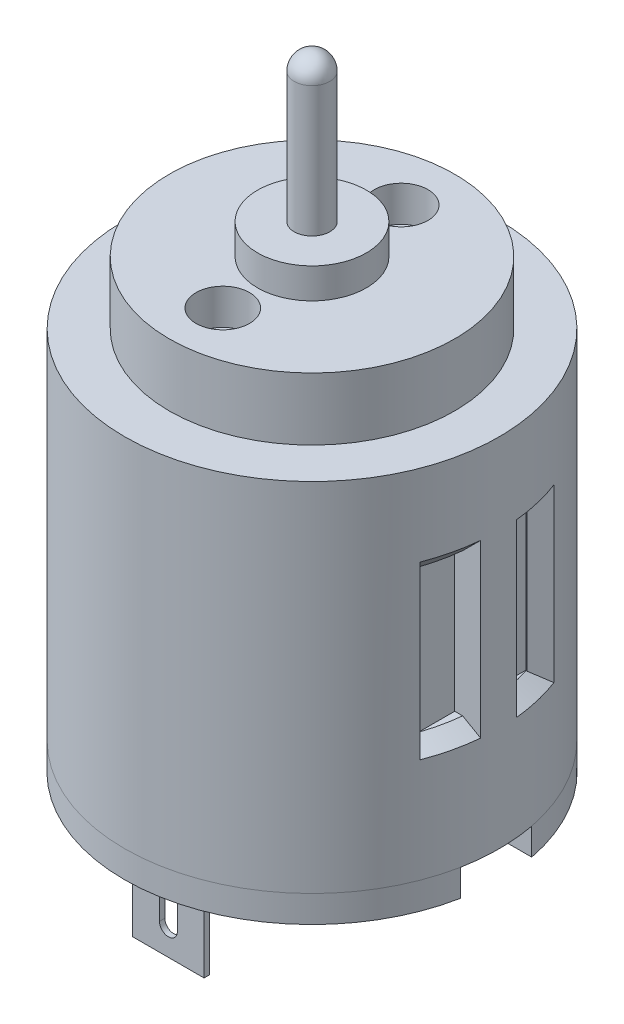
ISO-10303-21;
HEADER;
FILE_DESCRIPTION(('STEP AP214'),'2;1');
FILE_NAME('part.step','',(''),(''),'','','');
FILE_SCHEMA(('AUTOMOTIVE_DESIGN { 1 0 10303 214 1 1 1 1 }'));
ENDSEC;
DATA;
#1=APPLICATION_CONTEXT('core data for automotive mechanical design processes');
#2=APPLICATION_PROTOCOL_DEFINITION('international standard','automotive_design',2000,#1);
#3=PRODUCT_CONTEXT('',#1,'mechanical');
#4=PRODUCT('Part','Part','',(#3));
#5=PRODUCT_RELATED_PRODUCT_CATEGORY('part','',(#4));
#6=PRODUCT_DEFINITION_FORMATION('','',#4);
#7=PRODUCT_DEFINITION_CONTEXT('part definition',#1,'design');
#8=PRODUCT_DEFINITION('design','',#6,#7);
#9=PRODUCT_DEFINITION_SHAPE('','',#8);
#10=(LENGTH_UNIT() NAMED_UNIT(*) SI_UNIT(.MILLI.,.METRE.));
#11=(NAMED_UNIT(*) PLANE_ANGLE_UNIT() SI_UNIT($,.RADIAN.));
#12=(NAMED_UNIT(*) SI_UNIT($,.STERADIAN.) SOLID_ANGLE_UNIT());
#13=UNCERTAINTY_MEASURE_WITH_UNIT(LENGTH_MEASURE(1.E-05),#10,'distance_accuracy_value','');
#14=(GEOMETRIC_REPRESENTATION_CONTEXT(3) GLOBAL_UNCERTAINTY_ASSIGNED_CONTEXT((#13)) GLOBAL_UNIT_ASSIGNED_CONTEXT((#10,
#11,#12)) REPRESENTATION_CONTEXT('',''));
#15=CARTESIAN_POINT('',(0.,0.,0.));
#16=DIRECTION('',(0.,0.,1.));
#17=DIRECTION('',(1.,0.,0.));
#18=AXIS2_PLACEMENT_3D('',#15,#16,#17);
#19=CARTESIAN_POINT('',(0.,1.5,0.));
#20=DIRECTION('',(0.,-1.,0.));
#21=DIRECTION('',(0.,0.,-1.));
#22=AXIS2_PLACEMENT_3D('',#19,#20,#21);
#23=CYLINDRICAL_SURFACE('',#22,10.51);
#24=CARTESIAN_POINT('',(0.,0.,0.));
#25=DIRECTION('',(0.,1.,0.));
#26=DIRECTION('',(0.,0.,1.));
#27=AXIS2_PLACEMENT_3D('',#24,#25,#26);
#28=CIRCLE('',#27,10.51);
#29=CARTESIAN_POINT('',(-10.3179503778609,0.,2.));
#30=VERTEX_POINT('',#29);
#31=CARTESIAN_POINT('',(10.3179503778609,0.,2.));
#32=VERTEX_POINT('',#31);
#33=EDGE_CURVE('E692',#30,#32,#28,.T.);
#34=ORIENTED_EDGE('',*,*,#33,.T.);
#35=DIRECTION('',(0.,-1.,0.));
#36=VECTOR('',#35,1.);
#37=CARTESIAN_POINT('',(10.3179503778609,1.5,2.));
#38=LINE('',#37,#36);
#39=CARTESIAN_POINT('',(10.3128572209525,1.5,2.));
#40=VERTEX_POINT('',#39);
#41=EDGE_CURVE('E1003',#32,#40,#38,.F.);
#42=ORIENTED_EDGE('',*,*,#41,.T.);
#43=CARTESIAN_POINT('',(0.,1.5,0.));
#44=DIRECTION('',(0.,1.,0.));
#45=DIRECTION('',(-0.981709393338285,0.,0.190385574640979));
#46=AXIS2_PLACEMENT_3D('',#43,#44,#45);
#47=CIRCLE('',#46,10.5);
#48=CARTESIAN_POINT('',(-10.3128571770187,1.5,2.00000046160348));
#49=VERTEX_POINT('',#48);
#50=EDGE_CURVE('E745',#49,#40,#47,.T.);
#51=ORIENTED_EDGE('',*,*,#50,.F.);
#52=DIRECTION('',(0.,-1.,0.));
#53=VECTOR('',#52,1.);
#54=CARTESIAN_POINT('',(-10.3179503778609,1.5,2.));
#55=LINE('',#54,#53);
#56=EDGE_CURVE('E444',#49,#30,#55,.T.);
#57=ORIENTED_EDGE('',*,*,#56,.T.);
#58=EDGE_LOOP('',(#34,#42,#51,#57));
#59=FACE_BOUND('',#58,.T.);
#60=ADVANCED_FACE('F32',(#59),#23,.T.);
#61=CARTESIAN_POINT('',(-15.5,15.9441554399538,-3.));
#62=DIRECTION('',(0.,0.,-1.));
#63=DIRECTION('',(-1.,0.,0.));
#64=AXIS2_PLACEMENT_3D('',#61,#62,#63);
#65=PLANE('',#64);
#66=CARTESIAN_POINT('',(-9.01387818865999,15.9441554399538,-3.));
#67=CARTESIAN_POINT('',(-9.18902902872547,16.110389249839,-3.));
#68=CARTESIAN_POINT('',(-9.36397343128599,16.2768394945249,-3.));
#69=CARTESIAN_POINT('',(-9.71344933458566,16.6101728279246,-3.));
#70=CARTESIAN_POINT('',(-9.88798083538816,16.7770559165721,-3.));
#71=CARTESIAN_POINT('',(-10.0623058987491,16.9441554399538,-3.));
#72=B_SPLINE_CURVE_WITH_KNOTS('',3,(#66,#67,#68,#69,#70,#71),.UNSPECIFIED.,.F.,.F.,(4,2,4),(0.,
0.724431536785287,1.44886296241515),.UNSPECIFIED.);
#73=CARTESIAN_POINT('',(-9.01387818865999,15.9441554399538,-3.));
#74=VERTEX_POINT('',#73);
#75=CARTESIAN_POINT('',(-9.06230589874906,15.9901173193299,-3.));
#76=VERTEX_POINT('',#75);
#77=EDGE_CURVE('E908',#74,#76,#72,.T.);
#78=ORIENTED_EDGE('',*,*,#77,.T.);
#79=DIRECTION('',(0.,-1.,0.));
#80=VECTOR('',#79,1.);
#81=CARTESIAN_POINT('',(-9.06230589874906,15.9441554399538,-3.));
#82=LINE('',#81,#80);
#83=CARTESIAN_POINT('',(-9.0623058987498,7.89663316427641,-3.));
#84=VERTEX_POINT('',#83);
#85=EDGE_CURVE('E1673',#76,#84,#82,.T.);
#86=ORIENTED_EDGE('',*,*,#85,.T.);
#87=CARTESIAN_POINT('',(-10.0623058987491,7.34581899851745,-3.));
#88=CARTESIAN_POINT('',(-9.88776963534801,7.44241027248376,-3.));
#89=CARTESIAN_POINT('',(-9.71313253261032,7.53881842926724,-3.));
#90=CARTESIAN_POINT('',(-9.36365662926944,7.73126851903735,-3.));
#91=CARTESIAN_POINT('',(-9.1888178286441,7.82731045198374,-3.));
#92=CARTESIAN_POINT('',(-9.01387818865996,7.92316926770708,-3.));
#93=B_SPLINE_CURVE_WITH_KNOTS('',3,(#87,#88,#89,#90,#91,#92),.UNSPECIFIED.,.F.,.F.,(4,2,4),(0.,
0.598442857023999,1.19688577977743),.UNSPECIFIED.);
#94=CARTESIAN_POINT('',(-9.01387818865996,7.92316926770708,-3.));
#95=VERTEX_POINT('',#94);
#96=EDGE_CURVE('E915',#84,#95,#93,.T.);
#97=ORIENTED_EDGE('',*,*,#96,.T.);
#98=DIRECTION('',(1.,0.,0.));
#99=VECTOR('',#98,1.);
#100=CARTESIAN_POINT('',(-15.5,7.92316926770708,-3.));
#101=LINE('',#100,#99);
#102=CARTESIAN_POINT('',(-9.,7.92316926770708,-3.));
#103=VERTEX_POINT('',#102);
#104=EDGE_CURVE('E515',#95,#103,#101,.T.);
#105=ORIENTED_EDGE('',*,*,#104,.T.);
#106=DIRECTION('',(0.,-1.,0.));
#107=VECTOR('',#106,1.);
#108=CARTESIAN_POINT('',(-9.,15.9441554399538,-3.));
#109=LINE('',#108,#107);
#110=CARTESIAN_POINT('',(-9.,15.9441554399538,-3.));
#111=VERTEX_POINT('',#110);
#112=EDGE_CURVE('E478',#111,#103,#109,.T.);
#113=ORIENTED_EDGE('',*,*,#112,.F.);
#114=DIRECTION('',(1.,0.,0.));
#115=VECTOR('',#114,1.);
#116=CARTESIAN_POINT('',(-15.5,15.9441554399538,-3.));
#117=LINE('',#116,#115);
#118=EDGE_CURVE('E525',#74,#111,#117,.T.);
#119=ORIENTED_EDGE('',*,*,#118,.F.);
#120=EDGE_LOOP('',(#78,#86,#97,#105,#113,#119));
#121=FACE_BOUND('',#120,.T.);
#122=ADVANCED_FACE('F724',(#121),#65,.F.);
#123=CARTESIAN_POINT('',(-15.5,7.92316926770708,-3.));
#124=DIRECTION('',(0.,-1.,0.));
#125=DIRECTION('',(0.,0.,-1.));
#126=AXIS2_PLACEMENT_3D('',#123,#124,#125);
#127=PLANE('',#126);
#128=ORIENTED_EDGE('',*,*,#104,.F.);
#129=CARTESIAN_POINT('',(0.,7.92316926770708,0.));
#130=DIRECTION('',(0.,-1.,0.));
#131=DIRECTION('',(0.,0.,-1.));
#132=AXIS2_PLACEMENT_3D('',#129,#130,#131);
#133=CIRCLE('',#132,9.49999999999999);
#134=CARTESIAN_POINT('',(-9.44722181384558,7.92316926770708,-1.));
#135=VERTEX_POINT('',#134);
#136=EDGE_CURVE('E1783',#95,#135,#133,.F.);
#137=ORIENTED_EDGE('',*,*,#136,.T.);
#138=DIRECTION('',(1.,0.,0.));
#139=VECTOR('',#138,1.);
#140=CARTESIAN_POINT('',(-15.5,7.92316926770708,-1.));
#141=LINE('',#140,#139);
#142=CARTESIAN_POINT('',(-9.,7.92316926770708,-1.));
#143=VERTEX_POINT('',#142);
#144=EDGE_CURVE('E519',#135,#143,#141,.T.);
#145=ORIENTED_EDGE('',*,*,#144,.T.);
#146=DIRECTION('',(0.,0.,1.));
#147=VECTOR('',#146,1.);
#148=CARTESIAN_POINT('',(-9.,7.92316926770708,-3.));
#149=LINE('',#148,#147);
#150=EDGE_CURVE('E475',#103,#143,#149,.T.);
#151=ORIENTED_EDGE('',*,*,#150,.F.);
#152=EDGE_LOOP('',(#128,#137,#145,#151));
#153=FACE_BOUND('',#152,.T.);
#154=ADVANCED_FACE('F729',(#153),#127,.F.);
#155=CARTESIAN_POINT('',(-15.5,15.9441554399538,-1.));
#156=DIRECTION('',(0.,0.,1.));
#157=DIRECTION('',(0.,-1.,0.));
#158=AXIS2_PLACEMENT_3D('',#155,#156,#157);
#159=PLANE('',#158);
#160=DIRECTION('',(0.,1.,0.));
#161=VECTOR('',#160,1.);
#162=CARTESIAN_POINT('',(-9.,15.9441554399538,-1.));
#163=LINE('',#162,#161);
#164=CARTESIAN_POINT('',(-9.,15.9441554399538,-1.));
#165=VERTEX_POINT('',#164);
#166=EDGE_CURVE('E472',#143,#165,#163,.T.);
#167=ORIENTED_EDGE('',*,*,#166,.F.);
#168=ORIENTED_EDGE('',*,*,#144,.F.);
#169=CARTESIAN_POINT('',(-9.44722181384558,7.92316926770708,-1.));
#170=CARTESIAN_POINT('',(-9.61475130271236,7.82698085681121,-1.));
#171=CARTESIAN_POINT('',(-9.78227026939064,7.73077412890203,-1.));
#172=CARTESIAN_POINT('',(-10.1172871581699,7.53832403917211,-1.));
#173=CARTESIAN_POINT('',(-10.2847850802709,7.44208067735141,-1.));
#174=CARTESIAN_POINT('',(-10.4522724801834,7.34581899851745,-1.));
#175=B_SPLINE_CURVE_WITH_KNOTS('',3,(#169,#170,#171,#172,#173,#174),.UNSPECIFIED.,.F.,.F.,(4,2,
4),(0.,0.57953865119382,1.15907730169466),.UNSPECIFIED.);
#176=CARTESIAN_POINT('',(-10.4522724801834,7.34581899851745,-1.));
#177=VERTEX_POINT('',#176);
#178=EDGE_CURVE('E922',#135,#177,#175,.T.);
#179=ORIENTED_EDGE('',*,*,#178,.T.);
#180=DIRECTION('',(0.,-1.,0.));
#181=VECTOR('',#180,1.);
#182=CARTESIAN_POINT('',(-10.4522724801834,21.5,-1.));
#183=LINE('',#182,#181);
#184=CARTESIAN_POINT('',(-10.4522724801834,16.9441554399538,-1.));
#185=VERTEX_POINT('',#184);
#186=EDGE_CURVE('E785',#185,#177,#183,.T.);
#187=ORIENTED_EDGE('',*,*,#186,.F.);
#188=CARTESIAN_POINT('',(-10.4522724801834,16.9441554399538,-1.));
#189=CARTESIAN_POINT('',(-10.2848062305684,16.7774463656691,-1.));
#190=CARTESIAN_POINT('',(-10.1173188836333,16.6107584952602,-1.));
#191=CARTESIAN_POINT('',(-9.78230199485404,16.2774251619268,-1.));
#192=CARTESIAN_POINT('',(-9.61477245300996,16.1107796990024,-1.));
#193=CARTESIAN_POINT('',(-9.4472218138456,15.9441554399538,-1.));
#194=B_SPLINE_CURVE_WITH_KNOTS('',3,(#188,#189,#190,#191,#192,#193),.UNSPECIFIED.,.F.,.F.,(4,2,
4),(0.,0.708894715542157,1.41778943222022),.UNSPECIFIED.);
#195=CARTESIAN_POINT('',(-9.4472218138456,15.9441554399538,-1.));
#196=VERTEX_POINT('',#195);
#197=EDGE_CURVE('E1636',#185,#196,#194,.T.);
#198=ORIENTED_EDGE('',*,*,#197,.T.);
#199=DIRECTION('',(1.,0.,0.));
#200=VECTOR('',#199,1.);
#201=CARTESIAN_POINT('',(-15.5,15.9441554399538,-1.));
#202=LINE('',#201,#200);
#203=EDGE_CURVE('E522',#196,#165,#202,.T.);
#204=ORIENTED_EDGE('',*,*,#203,.T.);
#205=EDGE_LOOP('',(#167,#168,#179,#187,#198,#204));
#206=FACE_BOUND('',#205,.T.);
#207=ADVANCED_FACE('F1147',(#206),#159,.F.);
#208=CARTESIAN_POINT('',(-15.5,15.9441554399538,-1.));
#209=DIRECTION('',(0.,1.,0.));
#210=DIRECTION('',(0.,0.,1.));
#211=AXIS2_PLACEMENT_3D('',#208,#209,#210);
#212=PLANE('',#211);
#213=ORIENTED_EDGE('',*,*,#203,.F.);
#214=CARTESIAN_POINT('',(0.,15.9441554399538,0.));
#215=DIRECTION('',(0.,1.,0.));
#216=DIRECTION('',(0.,0.,1.));
#217=AXIS2_PLACEMENT_3D('',#214,#215,#216);
#218=CIRCLE('',#217,9.50000000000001);
#219=EDGE_CURVE('E1637',#196,#74,#218,.F.);
#220=ORIENTED_EDGE('',*,*,#219,.T.);
#221=ORIENTED_EDGE('',*,*,#118,.T.);
#222=DIRECTION('',(0.,0.,-1.));
#223=VECTOR('',#222,1.);
#224=CARTESIAN_POINT('',(-9.,15.9441554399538,-1.));
#225=LINE('',#224,#223);
#226=EDGE_CURVE('E469',#165,#111,#225,.T.);
#227=ORIENTED_EDGE('',*,*,#226,.F.);
#228=EDGE_LOOP('',(#213,#220,#221,#227));
#229=FACE_BOUND('',#228,.T.);
#230=ADVANCED_FACE('F1141',(#229),#212,.F.);
#231=CARTESIAN_POINT('',(-15.5,15.9441554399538,3.));
#232=DIRECTION('',(0.,0.,1.));
#233=DIRECTION('',(0.,-1.,0.));
#234=AXIS2_PLACEMENT_3D('',#231,#232,#233);
#235=PLANE('',#234);
#236=CARTESIAN_POINT('',(-9.01387818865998,7.92316926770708,3.));
#237=CARTESIAN_POINT('',(-9.18881782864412,7.82731045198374,3.));
#238=CARTESIAN_POINT('',(-9.36365662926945,7.73126851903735,3.));
#239=CARTESIAN_POINT('',(-9.71313253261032,7.53881842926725,3.));
#240=CARTESIAN_POINT('',(-9.88776963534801,7.44241027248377,3.));
#241=CARTESIAN_POINT('',(-10.0623058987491,7.34581899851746,3.));
#242=B_SPLINE_CURVE_WITH_KNOTS('',3,(#236,#237,#238,#239,#240,#241),.UNSPECIFIED.,.F.,.F.,(4,2,
4),(0.,0.59844292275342,1.19688577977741),.UNSPECIFIED.);
#243=CARTESIAN_POINT('',(-9.01387818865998,7.92316926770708,3.));
#244=VERTEX_POINT('',#243);
#245=CARTESIAN_POINT('',(-9.06230589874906,7.89663316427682,3.));
#246=VERTEX_POINT('',#245);
#247=EDGE_CURVE('E1754',#244,#246,#242,.T.);
#248=ORIENTED_EDGE('',*,*,#247,.T.);
#249=DIRECTION('',(0.,1.,0.));
#250=VECTOR('',#249,1.);
#251=CARTESIAN_POINT('',(-9.06230589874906,15.9441554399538,3.));
#252=LINE('',#251,#250);
#253=CARTESIAN_POINT('',(-9.06230589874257,15.9901173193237,3.));
#254=VERTEX_POINT('',#253);
#255=EDGE_CURVE('E1674',#246,#254,#252,.T.);
#256=ORIENTED_EDGE('',*,*,#255,.T.);
#257=CARTESIAN_POINT('',(-10.0623058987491,16.9441554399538,3.));
#258=CARTESIAN_POINT('',(-9.88798083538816,16.7770559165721,3.));
#259=CARTESIAN_POINT('',(-9.71344933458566,16.6101728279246,3.));
#260=CARTESIAN_POINT('',(-9.36397343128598,16.2768394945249,3.));
#261=CARTESIAN_POINT('',(-9.18902902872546,16.110389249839,3.));
#262=CARTESIAN_POINT('',(-9.01387818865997,15.9441554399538,3.));
#263=B_SPLINE_CURVE_WITH_KNOTS('',3,(#257,#258,#259,#260,#261,#262),.UNSPECIFIED.,.F.,.F.,(4,2,
4),(0.,0.724431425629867,1.44886296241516),.UNSPECIFIED.);
#264=CARTESIAN_POINT('',(-9.01387818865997,15.9441554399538,3.));
#265=VERTEX_POINT('',#264);
#266=EDGE_CURVE('E1748',#254,#265,#263,.T.);
#267=ORIENTED_EDGE('',*,*,#266,.T.);
#268=DIRECTION('',(1.,0.,0.));
#269=VECTOR('',#268,1.);
#270=CARTESIAN_POINT('',(-15.5,15.9441554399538,3.));
#271=LINE('',#270,#269);
#272=CARTESIAN_POINT('',(-9.,15.9441554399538,3.));
#273=VERTEX_POINT('',#272);
#274=EDGE_CURVE('E503',#265,#273,#271,.T.);
#275=ORIENTED_EDGE('',*,*,#274,.T.);
#276=DIRECTION('',(0.,1.,0.));
#277=VECTOR('',#276,1.);
#278=CARTESIAN_POINT('',(-9.,15.9441554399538,3.));
#279=LINE('',#278,#277);
#280=CARTESIAN_POINT('',(-9.,7.92316926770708,3.));
#281=VERTEX_POINT('',#280);
#282=EDGE_CURVE('E466',#281,#273,#279,.T.);
#283=ORIENTED_EDGE('',*,*,#282,.F.);
#284=DIRECTION('',(1.,0.,0.));
#285=VECTOR('',#284,1.);
#286=CARTESIAN_POINT('',(-15.5,7.92316926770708,3.));
#287=LINE('',#286,#285);
#288=EDGE_CURVE('E513',#244,#281,#287,.T.);
#289=ORIENTED_EDGE('',*,*,#288,.F.);
#290=EDGE_LOOP('',(#248,#256,#267,#275,#283,#289));
#291=FACE_BOUND('',#290,.T.);
#292=ADVANCED_FACE('F1134',(#291),#235,.F.);
#293=CARTESIAN_POINT('',(-15.5,15.9441554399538,3.));
#294=DIRECTION('',(0.,1.,0.));
#295=DIRECTION('',(0.,0.,1.));
#296=AXIS2_PLACEMENT_3D('',#293,#294,#295);
#297=PLANE('',#296);
#298=ORIENTED_EDGE('',*,*,#274,.F.);
#299=CARTESIAN_POINT('',(0.,15.9441554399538,0.));
#300=DIRECTION('',(0.,1.,0.));
#301=DIRECTION('',(0.,0.,1.));
#302=AXIS2_PLACEMENT_3D('',#299,#300,#301);
#303=CIRCLE('',#302,9.5);
#304=CARTESIAN_POINT('',(-9.44722181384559,15.9441554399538,1.));
#305=VERTEX_POINT('',#304);
#306=EDGE_CURVE('E1634',#265,#305,#303,.F.);
#307=ORIENTED_EDGE('',*,*,#306,.T.);
#308=DIRECTION('',(1.,0.,0.));
#309=VECTOR('',#308,1.);
#310=CARTESIAN_POINT('',(-15.5,15.9441554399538,1.));
#311=LINE('',#310,#309);
#312=CARTESIAN_POINT('',(-9.,15.9441554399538,1.));
#313=VERTEX_POINT('',#312);
#314=EDGE_CURVE('E507',#305,#313,#311,.T.);
#315=ORIENTED_EDGE('',*,*,#314,.T.);
#316=DIRECTION('',(0.,0.,-1.));
#317=VECTOR('',#316,1.);
#318=CARTESIAN_POINT('',(-9.,15.9441554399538,3.));
#319=LINE('',#318,#317);
#320=EDGE_CURVE('E463',#273,#313,#319,.T.);
#321=ORIENTED_EDGE('',*,*,#320,.F.);
#322=EDGE_LOOP('',(#298,#307,#315,#321));
#323=FACE_BOUND('',#322,.T.);
#324=ADVANCED_FACE('F1127',(#323),#297,.F.);
#325=CARTESIAN_POINT('',(-15.5,15.9441554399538,1.));
#326=DIRECTION('',(0.,0.,-1.));
#327=DIRECTION('',(-1.,0.,0.));
#328=AXIS2_PLACEMENT_3D('',#325,#326,#327);
#329=PLANE('',#328);
#330=DIRECTION('',(0.,-1.,0.));
#331=VECTOR('',#330,1.);
#332=CARTESIAN_POINT('',(-9.,15.9441554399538,1.));
#333=LINE('',#332,#331);
#334=CARTESIAN_POINT('',(-9.,7.92316926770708,1.));
#335=VERTEX_POINT('',#334);
#336=EDGE_CURVE('E458',#313,#335,#333,.T.);
#337=ORIENTED_EDGE('',*,*,#336,.F.);
#338=ORIENTED_EDGE('',*,*,#314,.F.);
#339=CARTESIAN_POINT('',(-9.44722181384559,15.9441554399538,1.));
#340=CARTESIAN_POINT('',(-9.61477245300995,16.1107796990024,1.));
#341=CARTESIAN_POINT('',(-9.78230199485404,16.2774251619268,1.));
#342=CARTESIAN_POINT('',(-10.1173188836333,16.6107584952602,1.));
#343=CARTESIAN_POINT('',(-10.2848062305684,16.7774463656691,1.));
#344=CARTESIAN_POINT('',(-10.4522724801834,16.9441554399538,1.));
#345=B_SPLINE_CURVE_WITH_KNOTS('',3,(#339,#340,#341,#342,#343,#344),.UNSPECIFIED.,.F.,.F.,(4,2,
4),(0.,0.708894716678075,1.41778943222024),.UNSPECIFIED.);
#346=CARTESIAN_POINT('',(-10.4522724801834,16.9441554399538,1.));
#347=VERTEX_POINT('',#346);
#348=EDGE_CURVE('E1787',#305,#347,#345,.T.);
#349=ORIENTED_EDGE('',*,*,#348,.T.);
#350=DIRECTION('',(0.,-1.,0.));
#351=VECTOR('',#350,1.);
#352=CARTESIAN_POINT('',(-10.4522724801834,21.5,1.));
#353=LINE('',#352,#351);
#354=CARTESIAN_POINT('',(-10.4522724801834,7.34581899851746,1.));
#355=VERTEX_POINT('',#354);
#356=EDGE_CURVE('E789',#355,#347,#353,.F.);
#357=ORIENTED_EDGE('',*,*,#356,.F.);
#358=CARTESIAN_POINT('',(-10.4522724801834,7.34581899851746,1.));
#359=CARTESIAN_POINT('',(-10.2847850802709,7.44208067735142,1.));
#360=CARTESIAN_POINT('',(-10.1172871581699,7.53832403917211,1.));
#361=CARTESIAN_POINT('',(-9.78227026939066,7.73077412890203,1.));
#362=CARTESIAN_POINT('',(-9.61475130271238,7.82698085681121,1.));
#363=CARTESIAN_POINT('',(-9.4472218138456,7.92316926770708,1.));
#364=B_SPLINE_CURVE_WITH_KNOTS('',3,(#358,#359,#360,#361,#362,#363),.UNSPECIFIED.,.F.,.F.,(4,2,
4),(0.,0.579538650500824,1.15907730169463),.UNSPECIFIED.);
#365=CARTESIAN_POINT('',(-9.4472218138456,7.92316926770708,1.));
#366=VERTEX_POINT('',#365);
#367=EDGE_CURVE('E1759',#355,#366,#364,.T.);
#368=ORIENTED_EDGE('',*,*,#367,.T.);
#369=DIRECTION('',(1.,0.,0.));
#370=VECTOR('',#369,1.);
#371=CARTESIAN_POINT('',(-15.5,7.92316926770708,1.));
#372=LINE('',#371,#370);
#373=EDGE_CURVE('E510',#366,#335,#372,.T.);
#374=ORIENTED_EDGE('',*,*,#373,.T.);
#375=EDGE_LOOP('',(#337,#338,#349,#357,#368,#374));
#376=FACE_BOUND('',#375,.T.);
#377=ADVANCED_FACE('F719',(#376),#329,.F.);
#378=CARTESIAN_POINT('',(-15.5,7.92316926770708,1.));
#379=DIRECTION('',(0.,-1.,0.));
#380=DIRECTION('',(0.,0.,-1.));
#381=AXIS2_PLACEMENT_3D('',#378,#379,#380);
#382=PLANE('',#381);
#383=ORIENTED_EDGE('',*,*,#373,.F.);
#384=CARTESIAN_POINT('',(0.,7.92316926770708,0.));
#385=DIRECTION('',(0.,-1.,0.));
#386=DIRECTION('',(0.,0.,-1.));
#387=AXIS2_PLACEMENT_3D('',#384,#385,#386);
#388=CIRCLE('',#387,9.50000000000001);
#389=EDGE_CURVE('E923',#366,#244,#388,.F.);
#390=ORIENTED_EDGE('',*,*,#389,.T.);
#391=ORIENTED_EDGE('',*,*,#288,.T.);
#392=DIRECTION('',(0.,0.,1.));
#393=VECTOR('',#392,1.);
#394=CARTESIAN_POINT('',(-9.,7.92316926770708,1.));
#395=LINE('',#394,#393);
#396=EDGE_CURVE('E793',#335,#281,#395,.T.);
#397=ORIENTED_EDGE('',*,*,#396,.F.);
#398=EDGE_LOOP('',(#383,#390,#391,#397));
#399=FACE_BOUND('',#398,.T.);
#400=ADVANCED_FACE('F710',(#399),#382,.F.);
#401=CARTESIAN_POINT('',(0.,0.,0.));
#402=DIRECTION('',(0.,1.,0.));
#403=DIRECTION('',(0.,0.,1.));
#404=AXIS2_PLACEMENT_3D('',#401,#402,#403);
#405=PLANE('',#404);
#406=DIRECTION('',(0.,0.,1.));
#407=VECTOR('',#406,1.);
#408=CARTESIAN_POINT('',(2.,0.,8.05));
#409=LINE('',#408,#407);
#410=CARTESIAN_POINT('',(2.,0.,7.75));
#411=VERTEX_POINT('',#410);
#412=CARTESIAN_POINT('',(2.,0.,8.05));
#413=VERTEX_POINT('',#412);
#414=EDGE_CURVE('E611',#411,#413,#409,.T.);
#415=ORIENTED_EDGE('',*,*,#414,.F.);
#416=DIRECTION('',(1.,0.,0.));
#417=VECTOR('',#416,1.);
#418=CARTESIAN_POINT('',(0.,0.,7.75));
#419=LINE('',#418,#417);
#420=CARTESIAN_POINT('',(-2.,0.,7.75));
#421=VERTEX_POINT('',#420);
#422=EDGE_CURVE('E620',#421,#411,#419,.T.);
#423=ORIENTED_EDGE('',*,*,#422,.F.);
#424=DIRECTION('',(0.,0.,-1.));
#425=VECTOR('',#424,1.);
#426=CARTESIAN_POINT('',(-2.,0.,8.05));
#427=LINE('',#426,#425);
#428=CARTESIAN_POINT('',(-2.,0.,8.05));
#429=VERTEX_POINT('',#428);
#430=EDGE_CURVE('E617',#429,#421,#427,.T.);
#431=ORIENTED_EDGE('',*,*,#430,.F.);
#432=DIRECTION('',(-1.,0.,0.));
#433=VECTOR('',#432,1.);
#434=CARTESIAN_POINT('',(0.,0.,8.05));
#435=LINE('',#434,#433);
#436=EDGE_CURVE('E614',#413,#429,#435,.T.);
#437=ORIENTED_EDGE('',*,*,#436,.F.);
#438=EDGE_LOOP('',(#415,#423,#431,#437));
#439=FACE_BOUND('',#438,.T.);
#440=CARTESIAN_POINT('',(8.01,0.,0.));
#441=DIRECTION('',(0.,-1.,0.));
#442=DIRECTION('',(0.,0.,-1.));
#443=AXIS2_PLACEMENT_3D('',#440,#441,#442);
#444=CIRCLE('',#443,2.);
#445=CARTESIAN_POINT('',(8.01,0.,2.));
#446=VERTEX_POINT('',#445);
#447=CARTESIAN_POINT('',(8.01,0.,-2.));
#448=VERTEX_POINT('',#447);
#449=EDGE_CURVE('E379',#446,#448,#444,.T.);
#450=ORIENTED_EDGE('',*,*,#449,.F.);
#451=DIRECTION('',(-1.,0.,0.));
#452=VECTOR('',#451,1.);
#453=CARTESIAN_POINT('',(8.01,0.,2.));
#454=LINE('',#453,#452);
#455=EDGE_CURVE('E390',#32,#446,#454,.T.);
#456=ORIENTED_EDGE('',*,*,#455,.F.);
#457=ORIENTED_EDGE('',*,*,#33,.F.);
#458=DIRECTION('',(-1.,0.,0.));
#459=VECTOR('',#458,1.);
#460=CARTESIAN_POINT('',(-8.01,0.,2.));
#461=LINE('',#460,#459);
#462=CARTESIAN_POINT('',(-8.01,0.,2.));
#463=VERTEX_POINT('',#462);
#464=EDGE_CURVE('E989',#463,#30,#461,.T.);
#465=ORIENTED_EDGE('',*,*,#464,.F.);
#466=CARTESIAN_POINT('',(-8.01,0.,0.));
#467=DIRECTION('',(0.,-1.,0.));
#468=DIRECTION('',(0.,0.,-1.));
#469=AXIS2_PLACEMENT_3D('',#466,#467,#468);
#470=CIRCLE('',#469,2.);
#471=CARTESIAN_POINT('',(-8.01,0.,-2.));
#472=VERTEX_POINT('',#471);
#473=EDGE_CURVE('E1000',#472,#463,#470,.T.);
#474=ORIENTED_EDGE('',*,*,#473,.F.);
#475=DIRECTION('',(1.,0.,0.));
#476=VECTOR('',#475,1.);
#477=CARTESIAN_POINT('',(-8.01,0.,-2.));
#478=LINE('',#477,#476);
#479=CARTESIAN_POINT('',(-10.3179503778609,0.,-2.));
#480=VERTEX_POINT('',#479);
#481=EDGE_CURVE('E987',#480,#472,#478,.T.);
#482=ORIENTED_EDGE('',*,*,#481,.F.);
#483=CARTESIAN_POINT('',(10.3179503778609,0.,-2.));
#484=VERTEX_POINT('',#483);
#485=EDGE_CURVE('E389',#484,#480,#28,.T.);
#486=ORIENTED_EDGE('',*,*,#485,.F.);
#487=DIRECTION('',(1.,0.,0.));
#488=VECTOR('',#487,1.);
#489=CARTESIAN_POINT('',(8.01,0.,-2.));
#490=LINE('',#489,#488);
#491=EDGE_CURVE('E370',#448,#484,#490,.T.);
#492=ORIENTED_EDGE('',*,*,#491,.F.);
#493=EDGE_LOOP('',(#450,#456,#457,#465,#474,#482,#486,#492));
#494=FACE_BOUND('',#493,.T.);
#495=CARTESIAN_POINT('',(0.,0.,0.));
#496=DIRECTION('',(0.,1.,0.));
#497=DIRECTION('',(0.,0.,1.));
#498=AXIS2_PLACEMENT_3D('',#495,#496,#497);
#499=CIRCLE('',#498,3.1);
#500=CARTESIAN_POINT('',(0.,0.,3.1));
#501=VERTEX_POINT('',#500);
#502=EDGE_CURVE('E752',#501,#501,#499,.F.);
#503=ORIENTED_EDGE('',*,*,#502,.F.);
#504=EDGE_LOOP('',(#503));
#505=FACE_BOUND('',#504,.T.);
#506=DIRECTION('',(0.,0.,1.));
#507=VECTOR('',#506,1.);
#508=CARTESIAN_POINT('',(2.,0.,-7.75));
#509=LINE('',#508,#507);
#510=CARTESIAN_POINT('',(2.,0.,-8.05));
#511=VERTEX_POINT('',#510);
#512=CARTESIAN_POINT('',(2.,0.,-7.75));
#513=VERTEX_POINT('',#512);
#514=EDGE_CURVE('E578',#511,#513,#509,.T.);
#515=ORIENTED_EDGE('',*,*,#514,.F.);
#516=DIRECTION('',(1.,0.,0.));
#517=VECTOR('',#516,1.);
#518=CARTESIAN_POINT('',(0.,0.,-8.05));
#519=LINE('',#518,#517);
#520=CARTESIAN_POINT('',(-2.,0.,-8.05));
#521=VERTEX_POINT('',#520);
#522=EDGE_CURVE('E587',#521,#511,#519,.T.);
#523=ORIENTED_EDGE('',*,*,#522,.F.);
#524=DIRECTION('',(0.,0.,-1.));
#525=VECTOR('',#524,1.);
#526=CARTESIAN_POINT('',(-2.,0.,-7.75));
#527=LINE('',#526,#525);
#528=CARTESIAN_POINT('',(-2.,0.,-7.75));
#529=VERTEX_POINT('',#528);
#530=EDGE_CURVE('E584',#529,#521,#527,.T.);
#531=ORIENTED_EDGE('',*,*,#530,.F.);
#532=DIRECTION('',(-1.,0.,0.));
#533=VECTOR('',#532,1.);
#534=CARTESIAN_POINT('',(0.,0.,-7.75));
#535=LINE('',#534,#533);
#536=EDGE_CURVE('E581',#513,#529,#535,.T.);
#537=ORIENTED_EDGE('',*,*,#536,.F.);
#538=EDGE_LOOP('',(#515,#523,#531,#537));
#539=FACE_BOUND('',#538,.T.);
#540=ADVANCED_FACE('F386',(#439,#494,#505,#539),#405,.F.);
#541=CARTESIAN_POINT('',(0.,0.,0.));
#542=DIRECTION('',(0.,-1.,0.));
#543=DIRECTION('',(0.,0.,-1.));
#544=AXIS2_PLACEMENT_3D('',#541,#542,#543);
#545=PLANE('',#544);
#546=CARTESIAN_POINT('',(0.,0.,0.));
#547=DIRECTION('',(0.,-1.,0.));
#548=DIRECTION('',(0.,0.,-1.));
#549=AXIS2_PLACEMENT_3D('',#546,#547,#548);
#550=CIRCLE('',#549,1.25);
#551=CARTESIAN_POINT('',(0.,0.,-1.25));
#552=VERTEX_POINT('',#551);
#553=EDGE_CURVE('E662',#552,#552,#550,.T.);
#554=ORIENTED_EDGE('',*,*,#553,.T.);
#555=EDGE_LOOP('',(#554));
#556=FACE_BOUND('',#555,.T.);
#557=CARTESIAN_POINT('',(0.,0.,0.));
#558=DIRECTION('',(0.,-1.,0.));
#559=DIRECTION('',(0.,0.,-1.));
#560=AXIS2_PLACEMENT_3D('',#557,#558,#559);
#561=CIRCLE('',#560,1.);
#562=CARTESIAN_POINT('',(0.,0.,-1.));
#563=VERTEX_POINT('',#562);
#564=EDGE_CURVE('E656',#563,#563,#561,.T.);
#565=ORIENTED_EDGE('',*,*,#564,.F.);
#566=EDGE_LOOP('',(#565));
#567=FACE_BOUND('',#566,.T.);
#568=ADVANCED_FACE('F709',(#556,#567),#545,.T.);
#569=CARTESIAN_POINT('',(0.,26.7,0.));
#570=DIRECTION('',(0.,1.,0.));
#571=DIRECTION('',(0.,0.,1.));
#572=AXIS2_PLACEMENT_3D('',#569,#570,#571);
#573=PLANE('',#572);
#574=CARTESIAN_POINT('',(0.,26.7,0.));
#575=DIRECTION('',(0.,1.,0.));
#576=DIRECTION('',(0.,0.,1.));
#577=AXIS2_PLACEMENT_3D('',#574,#575,#576);
#578=CIRCLE('',#577,3.05);
#579=CARTESIAN_POINT('',(0.,26.7,3.05));
#580=VERTEX_POINT('',#579);
#581=EDGE_CURVE('E671',#580,#580,#578,.T.);
#582=ORIENTED_EDGE('',*,*,#581,.T.);
#583=EDGE_LOOP('',(#582));
#584=FACE_BOUND('',#583,.T.);
#585=CARTESIAN_POINT('',(0.,26.7,0.));
#586=DIRECTION('',(0.,1.,0.));
#587=DIRECTION('',(0.,0.,1.));
#588=AXIS2_PLACEMENT_3D('',#585,#586,#587);
#589=CIRCLE('',#588,1.);
#590=CARTESIAN_POINT('',(0.,26.7,-1.));
#591=VERTEX_POINT('',#590);
#592=EDGE_CURVE('E665',#591,#591,#589,.T.);
#593=ORIENTED_EDGE('',*,*,#592,.F.);
#594=EDGE_LOOP('',(#593));
#595=FACE_BOUND('',#594,.T.);
#596=ADVANCED_FACE('F716',(#584,#595),#573,.T.);
#597=CARTESIAN_POINT('',(0.,25.,0.));
#598=DIRECTION('',(0.,1.,0.));
#599=DIRECTION('',(0.,0.,1.));
#600=AXIS2_PLACEMENT_3D('',#597,#598,#599);
#601=PLANE('',#600);
#602=CARTESIAN_POINT('',(0.,25.,-5.));
#603=DIRECTION('',(0.,1.,0.));
#604=DIRECTION('',(0.,0.,1.));
#605=AXIS2_PLACEMENT_3D('',#602,#603,#604);
#606=CIRCLE('',#605,1.5);
#607=CARTESIAN_POINT('',(0.,25.,-3.5));
#608=VERTEX_POINT('',#607);
#609=EDGE_CURVE('E644',#608,#608,#606,.T.);
#610=ORIENTED_EDGE('',*,*,#609,.F.);
#611=EDGE_LOOP('',(#610));
#612=FACE_BOUND('',#611,.T.);
#613=CARTESIAN_POINT('',(0.,25.,5.));
#614=DIRECTION('',(0.,1.,0.));
#615=DIRECTION('',(0.,0.,1.));
#616=AXIS2_PLACEMENT_3D('',#613,#614,#615);
#617=CIRCLE('',#616,1.5);
#618=CARTESIAN_POINT('',(0.,25.,6.5));
#619=VERTEX_POINT('',#618);
#620=EDGE_CURVE('E650',#619,#619,#617,.T.);
#621=ORIENTED_EDGE('',*,*,#620,.F.);
#622=EDGE_LOOP('',(#621));
#623=FACE_BOUND('',#622,.T.);
#624=CARTESIAN_POINT('',(0.,25.,0.));
#625=DIRECTION('',(0.,1.,0.));
#626=DIRECTION('',(0.,0.,1.));
#627=AXIS2_PLACEMENT_3D('',#624,#625,#626);
#628=CIRCLE('',#627,8.);
#629=CARTESIAN_POINT('',(0.,25.,8.));
#630=VERTEX_POINT('',#629);
#631=EDGE_CURVE('E677',#630,#630,#628,.T.);
#632=ORIENTED_EDGE('',*,*,#631,.T.);
#633=EDGE_LOOP('',(#632));
#634=FACE_BOUND('',#633,.T.);
#635=CARTESIAN_POINT('',(0.,25.,0.));
#636=DIRECTION('',(0.,1.,0.));
#637=DIRECTION('',(0.,0.,1.));
#638=AXIS2_PLACEMENT_3D('',#635,#636,#637);
#639=CIRCLE('',#638,3.05);
#640=CARTESIAN_POINT('',(0.,25.,3.05));
#641=VERTEX_POINT('',#640);
#642=EDGE_CURVE('E668',#641,#641,#639,.T.);
#643=ORIENTED_EDGE('',*,*,#642,.F.);
#644=EDGE_LOOP('',(#643));
#645=FACE_BOUND('',#644,.T.);
#646=ADVANCED_FACE('F739',(#612,#623,#634,#645),#601,.T.);
#647=CARTESIAN_POINT('',(0.,21.5,0.));
#648=DIRECTION('',(0.,1.,0.));
#649=DIRECTION('',(0.,0.,1.));
#650=AXIS2_PLACEMENT_3D('',#647,#648,#649);
#651=PLANE('',#650);
#652=CARTESIAN_POINT('',(0.,21.5,0.));
#653=DIRECTION('',(0.,1.,0.));
#654=DIRECTION('',(0.,0.,1.));
#655=AXIS2_PLACEMENT_3D('',#652,#653,#654);
#656=CIRCLE('',#655,10.5);
#657=CARTESIAN_POINT('',(0.,21.5,10.5));
#658=VERTEX_POINT('',#657);
#659=EDGE_CURVE('E680',#658,#658,#656,.T.);
#660=ORIENTED_EDGE('',*,*,#659,.T.);
#661=EDGE_LOOP('',(#660));
#662=FACE_BOUND('',#661,.T.);
#663=CARTESIAN_POINT('',(0.,21.5,0.));
#664=DIRECTION('',(0.,1.,0.));
#665=DIRECTION('',(0.,0.,1.));
#666=AXIS2_PLACEMENT_3D('',#663,#664,#665);
#667=CIRCLE('',#666,8.);
#668=CARTESIAN_POINT('',(0.,21.5,8.));
#669=VERTEX_POINT('',#668);
#670=EDGE_CURVE('E674',#669,#669,#667,.T.);
#671=ORIENTED_EDGE('',*,*,#670,.F.);
#672=EDGE_LOOP('',(#671));
#673=FACE_BOUND('',#672,.T.);
#674=ADVANCED_FACE('F706',(#662,#673),#651,.T.);
#675=CARTESIAN_POINT('',(0.,1.5,0.));
#676=DIRECTION('',(0.,1.,0.));
#677=DIRECTION('',(0.981709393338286,0.,-0.190385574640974));
#678=AXIS2_PLACEMENT_3D('',#675,#676,#677);
#679=CIRCLE('',#678,10.5);
#680=CARTESIAN_POINT('',(10.3128571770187,1.5,-2.00000046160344));
#681=VERTEX_POINT('',#680);
#682=CARTESIAN_POINT('',(-10.3128572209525,1.5,-2.));
#683=VERTEX_POINT('',#682);
#684=EDGE_CURVE('E741',#681,#683,#679,.T.);
#685=ORIENTED_EDGE('',*,*,#684,.F.);
#686=DIRECTION('',(0.,-1.,0.));
#687=VECTOR('',#686,1.);
#688=CARTESIAN_POINT('',(10.3179503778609,1.5,-2.));
#689=LINE('',#688,#687);
#690=EDGE_CURVE('E411',#681,#484,#689,.T.);
#691=ORIENTED_EDGE('',*,*,#690,.T.);
#692=ORIENTED_EDGE('',*,*,#485,.T.);
#693=DIRECTION('',(0.,-1.,0.));
#694=VECTOR('',#693,1.);
#695=CARTESIAN_POINT('',(-10.3179503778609,1.5,-2.));
#696=LINE('',#695,#694);
#697=EDGE_CURVE('E452',#480,#683,#696,.F.);
#698=ORIENTED_EDGE('',*,*,#697,.T.);
#699=EDGE_LOOP('',(#685,#691,#692,#698));
#700=FACE_BOUND('',#699,.T.);
#701=ADVANCED_FACE('F34',(#700),#23,.T.);
#702=CARTESIAN_POINT('',(0.,21.5,0.));
#703=DIRECTION('',(0.,-1.,0.));
#704=DIRECTION('',(0.,0.,-1.));
#705=AXIS2_PLACEMENT_3D('',#702,#703,#704);
#706=CYLINDRICAL_SURFACE('',#705,10.5);
#707=DIRECTION('',(0.,-1.,0.));
#708=VECTOR('',#707,1.);
#709=CARTESIAN_POINT('',(9.80884516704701,21.5,3.74653926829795));
#710=LINE('',#709,#708);
#711=CARTESIAN_POINT('',(9.80884516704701,7.34581899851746,3.74653926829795));
#712=VERTEX_POINT('',#711);
#713=CARTESIAN_POINT('',(9.80884516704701,16.9441554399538,3.74653926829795));
#714=VERTEX_POINT('',#713);
#715=EDGE_CURVE('E1706',#712,#714,#710,.F.);
#716=ORIENTED_EDGE('',*,*,#715,.T.);
#717=CARTESIAN_POINT('',(0.,16.9441554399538,0.));
#718=DIRECTION('',(0.,1.,0.));
#719=DIRECTION('',(0.,0.,1.));
#720=AXIS2_PLACEMENT_3D('',#717,#718,#719);
#721=CIRCLE('',#720,10.5);
#722=CARTESIAN_POINT('',(10.4522724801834,16.9441554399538,1.));
#723=VERTEX_POINT('',#722);
#724=EDGE_CURVE('E801',#714,#723,#721,.T.);
#725=ORIENTED_EDGE('',*,*,#724,.T.);
#726=DIRECTION('',(0.,-1.,0.));
#727=VECTOR('',#726,1.);
#728=CARTESIAN_POINT('',(10.4522724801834,21.5,1.));
#729=LINE('',#728,#727);
#730=CARTESIAN_POINT('',(10.4522724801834,7.34581899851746,1.));
#731=VERTEX_POINT('',#730);
#732=EDGE_CURVE('E791',#723,#731,#729,.T.);
#733=ORIENTED_EDGE('',*,*,#732,.T.);
#734=CARTESIAN_POINT('',(0.,7.34581899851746,0.));
#735=DIRECTION('',(0.,-1.,0.));
#736=DIRECTION('',(0.,0.,-1.));
#737=AXIS2_PLACEMENT_3D('',#734,#735,#736);
#738=CIRCLE('',#737,10.5);
#739=EDGE_CURVE('E1700',#731,#712,#738,.T.);
#740=ORIENTED_EDGE('',*,*,#739,.T.);
#741=EDGE_LOOP('',(#716,#725,#733,#740));
#742=FACE_BOUND('',#741,.T.);
#743=DIRECTION('',(0.,-1.,0.));
#744=VECTOR('',#743,1.);
#745=CARTESIAN_POINT('',(-9.80884516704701,21.5,3.74653926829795));
#746=LINE('',#745,#744);
#747=CARTESIAN_POINT('',(-9.80884516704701,16.9441554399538,3.74653926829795));
#748=VERTEX_POINT('',#747);
#749=CARTESIAN_POINT('',(-9.80884516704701,7.34581899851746,3.74653926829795));
#750=VERTEX_POINT('',#749);
#751=EDGE_CURVE('E1680',#748,#750,#746,.T.);
#752=ORIENTED_EDGE('',*,*,#751,.T.);
#753=CARTESIAN_POINT('',(0.,7.34581899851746,0.));
#754=DIRECTION('',(0.,-1.,0.));
#755=DIRECTION('',(0.,0.,-1.));
#756=AXIS2_PLACEMENT_3D('',#753,#754,#755);
#757=CIRCLE('',#756,10.5);
#758=EDGE_CURVE('E1784',#750,#355,#757,.T.);
#759=ORIENTED_EDGE('',*,*,#758,.T.);
#760=ORIENTED_EDGE('',*,*,#356,.T.);
#761=CARTESIAN_POINT('',(0.,16.9441554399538,0.));
#762=DIRECTION('',(0.,1.,0.));
#763=DIRECTION('',(0.,0.,1.));
#764=AXIS2_PLACEMENT_3D('',#761,#762,#763);
#765=CIRCLE('',#764,10.5);
#766=EDGE_CURVE('E1658',#347,#748,#765,.T.);
#767=ORIENTED_EDGE('',*,*,#766,.T.);
#768=EDGE_LOOP('',(#752,#759,#760,#767));
#769=FACE_BOUND('',#768,.T.);
#770=DIRECTION('',(0.,-1.,0.));
#771=VECTOR('',#770,1.);
#772=CARTESIAN_POINT('',(9.80884516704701,21.5,-3.74653926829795));
#773=LINE('',#772,#771);
#774=CARTESIAN_POINT('',(9.80884516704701,16.9441554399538,-3.74653926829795));
#775=VERTEX_POINT('',#774);
#776=CARTESIAN_POINT('',(9.80884516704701,7.34581899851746,-3.74653926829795));
#777=VERTEX_POINT('',#776);
#778=EDGE_CURVE('E887',#775,#777,#773,.T.);
#779=ORIENTED_EDGE('',*,*,#778,.T.);
#780=CARTESIAN_POINT('',(0.,7.34581899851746,0.));
#781=DIRECTION('',(0.,-1.,0.));
#782=DIRECTION('',(0.,0.,-1.));
#783=AXIS2_PLACEMENT_3D('',#780,#781,#782);
#784=CIRCLE('',#783,10.5);
#785=CARTESIAN_POINT('',(10.4522724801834,7.34581899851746,-1.));
#786=VERTEX_POINT('',#785);
#787=EDGE_CURVE('E1712',#777,#786,#784,.T.);
#788=ORIENTED_EDGE('',*,*,#787,.T.);
#789=DIRECTION('',(0.,-1.,0.));
#790=VECTOR('',#789,1.);
#791=CARTESIAN_POINT('',(10.4522724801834,21.5,-1.));
#792=LINE('',#791,#790);
#793=CARTESIAN_POINT('',(10.4522724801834,16.9441554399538,-1.));
#794=VERTEX_POINT('',#793);
#795=EDGE_CURVE('E787',#786,#794,#792,.F.);
#796=ORIENTED_EDGE('',*,*,#795,.T.);
#797=CARTESIAN_POINT('',(0.,16.9441554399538,0.));
#798=DIRECTION('',(0.,1.,0.));
#799=DIRECTION('',(0.,0.,1.));
#800=AXIS2_PLACEMENT_3D('',#797,#798,#799);
#801=CIRCLE('',#800,10.5);
#802=EDGE_CURVE('E799',#794,#775,#801,.T.);
#803=ORIENTED_EDGE('',*,*,#802,.T.);
#804=EDGE_LOOP('',(#779,#788,#796,#803));
#805=FACE_BOUND('',#804,.T.);
#806=DIRECTION('',(0.,-1.,0.));
#807=VECTOR('',#806,1.);
#808=CARTESIAN_POINT('',(-9.80884516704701,21.5,-3.74653926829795));
#809=LINE('',#808,#807);
#810=CARTESIAN_POINT('',(-9.80884516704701,7.34581899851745,-3.74653926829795));
#811=VERTEX_POINT('',#810);
#812=CARTESIAN_POINT('',(-9.80884516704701,16.9441554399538,-3.74653926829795));
#813=VERTEX_POINT('',#812);
#814=EDGE_CURVE('E1665',#811,#813,#809,.F.);
#815=ORIENTED_EDGE('',*,*,#814,.T.);
#816=CARTESIAN_POINT('',(0.,16.9441554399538,0.));
#817=DIRECTION('',(0.,1.,0.));
#818=DIRECTION('',(0.,0.,1.));
#819=AXIS2_PLACEMENT_3D('',#816,#817,#818);
#820=CIRCLE('',#819,10.5);
#821=EDGE_CURVE('E1639',#813,#185,#820,.T.);
#822=ORIENTED_EDGE('',*,*,#821,.T.);
#823=ORIENTED_EDGE('',*,*,#186,.T.);
#824=CARTESIAN_POINT('',(0.,7.34581899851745,0.));
#825=DIRECTION('',(0.,-1.,0.));
#826=DIRECTION('',(0.,0.,-1.));
#827=AXIS2_PLACEMENT_3D('',#824,#825,#826);
#828=CIRCLE('',#827,10.5);
#829=EDGE_CURVE('E1781',#177,#811,#828,.T.);
#830=ORIENTED_EDGE('',*,*,#829,.T.);
#831=EDGE_LOOP('',(#815,#822,#823,#830));
#832=FACE_BOUND('',#831,.T.);
#833=ORIENTED_EDGE('',*,*,#659,.F.);
#834=EDGE_LOOP('',(#833));
#835=FACE_BOUND('',#834,.T.);
#836=CARTESIAN_POINT('',(0.,1.5,0.));
#837=DIRECTION('',(0.,1.,0.));
#838=DIRECTION('',(-0.981709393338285,0.,-0.19038557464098));
#839=AXIS2_PLACEMENT_3D('',#836,#837,#838);
#840=CIRCLE('',#839,10.5);
#841=EDGE_CURVE('E687',#683,#49,#840,.T.);
#842=ORIENTED_EDGE('',*,*,#841,.T.);
#843=ORIENTED_EDGE('',*,*,#50,.T.);
#844=CARTESIAN_POINT('',(0.,1.5,0.));
#845=DIRECTION('',(0.,1.,0.));
#846=DIRECTION('',(0.981709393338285,0.,0.190385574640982));
#847=AXIS2_PLACEMENT_3D('',#844,#845,#846);
#848=CIRCLE('',#847,10.5);
#849=EDGE_CURVE('E405',#40,#681,#848,.T.);
#850=ORIENTED_EDGE('',*,*,#849,.T.);
#851=ORIENTED_EDGE('',*,*,#684,.T.);
#852=EDGE_LOOP('',(#842,#843,#850,#851));
#853=FACE_BOUND('',#852,.T.);
#854=ADVANCED_FACE('F695',(#742,#769,#805,#832,#835,#853),#706,.T.);
#855=CARTESIAN_POINT('',(0.,25.,0.));
#856=DIRECTION('',(0.,-1.,0.));
#857=DIRECTION('',(0.,0.,-1.));
#858=AXIS2_PLACEMENT_3D('',#855,#856,#857);
#859=CYLINDRICAL_SURFACE('',#858,8.);
#860=ORIENTED_EDGE('',*,*,#631,.F.);
#861=EDGE_LOOP('',(#860));
#862=FACE_BOUND('',#861,.T.);
#863=ORIENTED_EDGE('',*,*,#670,.T.);
#864=EDGE_LOOP('',(#863));
#865=FACE_BOUND('',#864,.T.);
#866=ADVANCED_FACE('F704',(#862,#865),#859,.T.);
#867=CARTESIAN_POINT('',(0.,26.7,0.));
#868=DIRECTION('',(0.,-1.,0.));
#869=DIRECTION('',(0.,0.,-1.));
#870=AXIS2_PLACEMENT_3D('',#867,#868,#869);
#871=CYLINDRICAL_SURFACE('',#870,3.05);
#872=ORIENTED_EDGE('',*,*,#581,.F.);
#873=EDGE_LOOP('',(#872));
#874=FACE_BOUND('',#873,.T.);
#875=ORIENTED_EDGE('',*,*,#642,.T.);
#876=EDGE_LOOP('',(#875));
#877=FACE_BOUND('',#876,.T.);
#878=ADVANCED_FACE('F1394',(#874,#877),#871,.T.);
#879=CARTESIAN_POINT('',(0.,35.,0.));
#880=DIRECTION('',(0.,-1.,0.));
#881=DIRECTION('',(0.,0.,-1.));
#882=AXIS2_PLACEMENT_3D('',#879,#880,#881);
#883=CYLINDRICAL_SURFACE('',#882,1.);
#884=CARTESIAN_POINT('',(0.,34.,0.));
#885=DIRECTION('',(0.,-1.,0.));
#886=DIRECTION('',(0.,0.,-1.));
#887=AXIS2_PLACEMENT_3D('',#884,#885,#886);
#888=CIRCLE('',#887,1.);
#889=CARTESIAN_POINT('',(0.,34.,-1.));
#890=VERTEX_POINT('',#889);
#891=EDGE_CURVE('E764',#890,#890,#888,.T.);
#892=CARTESIAN_POINT('',(0.,34.,-1.));
#893=CARTESIAN_POINT('',(0.,33.9239583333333,-1.));
#894=CARTESIAN_POINT('',(0.,33.8479166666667,-1.));
#895=CARTESIAN_POINT('',(0.,33.6958333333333,-1.));
#896=CARTESIAN_POINT('',(0.,33.6197916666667,-1.));
#897=CARTESIAN_POINT('',(0.,33.4677083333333,-1.));
#898=CARTESIAN_POINT('',(0.,33.3916666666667,-1.));
#899=CARTESIAN_POINT('',(0.,33.2395833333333,-1.));
#900=CARTESIAN_POINT('',(0.,33.1635416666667,-1.));
#901=CARTESIAN_POINT('',(0.,33.0114583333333,-1.));
#902=CARTESIAN_POINT('',(0.,32.9354166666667,-1.));
#903=CARTESIAN_POINT('',(0.,32.7833333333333,-1.));
#904=CARTESIAN_POINT('',(0.,32.7072916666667,-1.));
#905=CARTESIAN_POINT('',(0.,32.5552083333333,-1.));
#906=CARTESIAN_POINT('',(0.,32.4791666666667,-1.));
#907=CARTESIAN_POINT('',(0.,32.3270833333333,-1.));
#908=CARTESIAN_POINT('',(0.,32.2510416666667,-1.));
#909=CARTESIAN_POINT('',(0.,32.0989583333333,-1.));
#910=CARTESIAN_POINT('',(0.,32.0229166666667,-1.));
#911=CARTESIAN_POINT('',(0.,31.8708333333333,-1.));
#912=CARTESIAN_POINT('',(0.,31.7947916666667,-1.));
#913=CARTESIAN_POINT('',(0.,31.6427083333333,-1.));
#914=CARTESIAN_POINT('',(0.,31.5666666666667,-1.));
#915=CARTESIAN_POINT('',(0.,31.4145833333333,-1.));
#916=CARTESIAN_POINT('',(0.,31.3385416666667,-1.));
#917=CARTESIAN_POINT('',(0.,31.1864583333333,-1.));
#918=CARTESIAN_POINT('',(0.,31.1104166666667,-1.));
#919=CARTESIAN_POINT('',(0.,30.9583333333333,-1.));
#920=CARTESIAN_POINT('',(0.,30.8822916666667,-1.));
#921=CARTESIAN_POINT('',(0.,30.7302083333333,-1.));
#922=CARTESIAN_POINT('',(0.,30.6541666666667,-1.));
#923=CARTESIAN_POINT('',(0.,30.5020833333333,-1.));
#924=CARTESIAN_POINT('',(0.,30.4260416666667,-1.));
#925=CARTESIAN_POINT('',(0.,30.2739583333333,-1.));
#926=CARTESIAN_POINT('',(0.,30.1979166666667,-1.));
#927=CARTESIAN_POINT('',(0.,30.0458333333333,-1.));
#928=CARTESIAN_POINT('',(0.,29.9697916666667,-1.));
#929=CARTESIAN_POINT('',(0.,29.8177083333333,-1.));
#930=CARTESIAN_POINT('',(0.,29.7416666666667,-1.));
#931=CARTESIAN_POINT('',(0.,29.5895833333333,-1.));
#932=CARTESIAN_POINT('',(0.,29.5135416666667,-1.));
#933=CARTESIAN_POINT('',(0.,29.3614583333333,-1.));
#934=CARTESIAN_POINT('',(0.,29.2854166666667,-1.));
#935=CARTESIAN_POINT('',(0.,29.1333333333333,-1.));
#936=CARTESIAN_POINT('',(0.,29.0572916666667,-1.));
#937=CARTESIAN_POINT('',(0.,28.9052083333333,-1.));
#938=CARTESIAN_POINT('',(0.,28.8291666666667,-1.));
#939=CARTESIAN_POINT('',(0.,28.6770833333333,-1.));
#940=CARTESIAN_POINT('',(0.,28.6010416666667,-1.));
#941=CARTESIAN_POINT('',(0.,28.4489583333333,-1.));
#942=CARTESIAN_POINT('',(0.,28.3729166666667,-1.));
#943=CARTESIAN_POINT('',(0.,28.2208333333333,-1.));
#944=CARTESIAN_POINT('',(0.,28.1447916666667,-1.));
#945=CARTESIAN_POINT('',(0.,27.9927083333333,-1.));
#946=CARTESIAN_POINT('',(0.,27.9166666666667,-1.));
#947=CARTESIAN_POINT('',(0.,27.7645833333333,-1.));
#948=CARTESIAN_POINT('',(0.,27.6885416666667,-1.));
#949=CARTESIAN_POINT('',(0.,27.5364583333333,-1.));
#950=CARTESIAN_POINT('',(0.,27.4604166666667,-1.));
#951=CARTESIAN_POINT('',(0.,27.3083333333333,-1.));
#952=CARTESIAN_POINT('',(0.,27.2322916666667,-1.));
#953=CARTESIAN_POINT('',(0.,27.0802083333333,-1.));
#954=CARTESIAN_POINT('',(0.,27.0041666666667,-1.));
#955=CARTESIAN_POINT('',(0.,26.8520833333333,-1.));
#956=CARTESIAN_POINT('',(0.,26.7760416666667,-1.));
#957=CARTESIAN_POINT('',(0.,26.7,-1.));
#958=B_SPLINE_CURVE_WITH_KNOTS('',3,(#892,#893,#894,#895,#896,#897,#898,#899,#900,#901,#902,
#903,#904,#905,#906,#907,#908,#909,#910,#911,#912,#913,#914,#915,#916,#917,#918,#919,#920,#921,
#922,#923,#924,#925,#926,#927,#928,#929,#930,#931,#932,#933,#934,#935,#936,#937,#938,#939,#940,
#941,#942,#943,#944,#945,#946,#947,#948,#949,#950,#951,#952,#953,#954,#955,#956,#957),
.UNSPECIFIED.,.F.,.F.,(4,2,2,2,2,2,2,2,2,2,2,2,2,2,2,2,2,2,2,2,2,2,2,2,2,2,2,2,2,2,2,2,4),(0.,
0.228125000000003,0.456250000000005,0.684375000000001,0.912500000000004,1.14062500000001,
1.36875,1.596875,1.82500000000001,2.053125,2.28125000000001,2.50937500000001,2.7375,
2.96562500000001,3.19375000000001,3.421875,3.65000000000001,3.87812500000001,4.10625000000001,
4.33437500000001,4.56250000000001,4.79062500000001,5.01875000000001,5.24687500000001,
5.47500000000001,5.70312500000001,5.93125000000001,6.15937500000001,6.38750000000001,
6.61562500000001,6.84375000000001,7.07187500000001,7.30000000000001),.UNSPECIFIED.);
#959=EDGE_CURVE('BSEAM1387',#890,#591,#958,.T.);
#960=ORIENTED_EDGE('',*,*,#891,.T.);
#961=ORIENTED_EDGE('',*,*,#592,.T.);
#962=ORIENTED_EDGE('',*,*,#959,.T.);
#963=ORIENTED_EDGE('',*,*,#959,.F.);
#964=EDGE_LOOP('',(#960,#962,#961,#963));
#965=FACE_BOUND('',#964,.T.);
#966=ADVANCED_FACE('F1387',(#965),#883,.T.);
#967=CARTESIAN_POINT('',(0.,-3.,0.));
#968=DIRECTION('',(0.,1.,0.));
#969=DIRECTION('',(0.,0.,1.));
#970=AXIS2_PLACEMENT_3D('',#967,#968,#969);
#971=CYLINDRICAL_SURFACE('',#970,3.1);
#972=CARTESIAN_POINT('',(0.,-2.00000000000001,0.));
#973=DIRECTION('',(0.,-1.,0.));
#974=DIRECTION('',(0.,0.,-1.));
#975=AXIS2_PLACEMENT_3D('',#972,#973,#974);
#976=CIRCLE('',#975,3.1);
#977=CARTESIAN_POINT('',(0.,-2.00000000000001,-3.1));
#978=VERTEX_POINT('',#977);
#979=EDGE_CURVE('E770',#978,#978,#976,.F.);
#980=ORIENTED_EDGE('',*,*,#979,.T.);
#981=EDGE_LOOP('',(#980));
#982=FACE_BOUND('',#981,.T.);
#983=ORIENTED_EDGE('',*,*,#502,.T.);
#984=EDGE_LOOP('',(#983));
#985=FACE_BOUND('',#984,.T.);
#986=ADVANCED_FACE('F1380',(#982,#985),#971,.T.);
#987=CARTESIAN_POINT('',(0.,-3.,0.));
#988=DIRECTION('',(0.,-1.,0.));
#989=DIRECTION('',(0.,0.,-1.));
#990=AXIS2_PLACEMENT_3D('',#987,#988,#989);
#991=PLANE('',#990);
#992=CARTESIAN_POINT('',(0.,-3.,0.));
#993=DIRECTION('',(0.,-1.,0.));
#994=DIRECTION('',(0.,0.,-1.));
#995=AXIS2_PLACEMENT_3D('',#992,#993,#994);
#996=CIRCLE('',#995,2.1);
#997=CARTESIAN_POINT('',(0.,-3.,-2.1));
#998=VERTEX_POINT('',#997);
#999=EDGE_CURVE('E767',#998,#998,#996,.T.);
#1000=ORIENTED_EDGE('',*,*,#999,.T.);
#1001=EDGE_LOOP('',(#1000));
#1002=FACE_BOUND('',#1001,.T.);
#1003=CARTESIAN_POINT('',(0.,-3.,0.));
#1004=DIRECTION('',(0.,-1.,0.));
#1005=DIRECTION('',(0.,0.,-1.));
#1006=AXIS2_PLACEMENT_3D('',#1003,#1004,#1005);
#1007=CIRCLE('',#1006,1.25);
#1008=CARTESIAN_POINT('',(0.,-3.,-1.25));
#1009=VERTEX_POINT('',#1008);
#1010=EDGE_CURVE('E659',#1009,#1009,#1007,.T.);
#1011=ORIENTED_EDGE('',*,*,#1010,.F.);
#1012=EDGE_LOOP('',(#1011));
#1013=FACE_BOUND('',#1012,.T.);
#1014=ADVANCED_FACE('F1372',(#1002,#1013),#991,.T.);
#1015=CARTESIAN_POINT('',(0.,0.,0.));
#1016=DIRECTION('',(0.,-1.,0.));
#1017=DIRECTION('',(0.,0.,-1.));
#1018=AXIS2_PLACEMENT_3D('',#1015,#1016,#1017);
#1019=CYLINDRICAL_SURFACE('',#1018,1.25);
#1020=ORIENTED_EDGE('',*,*,#553,.F.);
#1021=EDGE_LOOP('',(#1020));
#1022=FACE_BOUND('',#1021,.T.);
#1023=ORIENTED_EDGE('',*,*,#1010,.T.);
#1024=EDGE_LOOP('',(#1023));
#1025=FACE_BOUND('',#1024,.T.);
#1026=ADVANCED_FACE('F1363',(#1022,#1025),#1019,.F.);
#1027=CARTESIAN_POINT('',(0.,-3.,0.));
#1028=DIRECTION('',(0.,1.,0.));
#1029=DIRECTION('',(0.,0.,1.));
#1030=AXIS2_PLACEMENT_3D('',#1027,#1028,#1029);
#1031=CYLINDRICAL_SURFACE('',#1030,1.);
#1032=CARTESIAN_POINT('',(0.,-2.,0.));
#1033=DIRECTION('',(0.,1.,0.));
#1034=DIRECTION('',(0.,0.,1.));
#1035=AXIS2_PLACEMENT_3D('',#1032,#1033,#1034);
#1036=CIRCLE('',#1035,1.);
#1037=CARTESIAN_POINT('',(0.,-2.,1.));
#1038=VERTEX_POINT('',#1037);
#1039=EDGE_CURVE('E761',#1038,#1038,#1036,.T.);
#1040=ORIENTED_EDGE('',*,*,#1039,.T.);
#1041=EDGE_LOOP('',(#1040));
#1042=FACE_BOUND('',#1041,.T.);
#1043=ORIENTED_EDGE('',*,*,#564,.T.);
#1044=EDGE_LOOP('',(#1043));
#1045=FACE_BOUND('',#1044,.T.);
#1046=ADVANCED_FACE('F1356',(#1042,#1045),#1031,.T.);
#1047=CARTESIAN_POINT('',(0.,-2.,0.));
#1048=DIRECTION('',(0.,0.,1.));
#1049=DIRECTION('',(1.,0.,0.));
#1050=AXIS2_PLACEMENT_3D('',#1047,#1048,#1049);
#1051=SPHERICAL_SURFACE('',#1050,1.);
#1052=CARTESIAN_POINT('',(0.,-2.,0.));
#1053=DIRECTION('',(0.,1.,0.));
#1054=DIRECTION('',(0.,0.,1.));
#1055=AXIS2_PLACEMENT_3D('',#1052,#1053,#1054);
#1056=SPHERICAL_SURFACE('',#1055,1.);
#1057=ORIENTED_EDGE('',*,*,#1039,.F.);
#1058=EDGE_LOOP('',(#1057));
#1059=FACE_BOUND('',#1058,.T.);
#1060=ADVANCED_FACE('F1346',(#1059),#1056,.T.);
#1061=CARTESIAN_POINT('',(0.,34.,0.));
#1062=DIRECTION('',(0.,0.,1.));
#1063=DIRECTION('',(1.,0.,0.));
#1064=AXIS2_PLACEMENT_3D('',#1061,#1062,#1063);
#1065=SPHERICAL_SURFACE('',#1064,1.);
#1066=CARTESIAN_POINT('',(0.,34.,0.));
#1067=DIRECTION('',(0.,-1.,0.));
#1068=DIRECTION('',(0.,0.,-1.));
#1069=AXIS2_PLACEMENT_3D('',#1066,#1067,#1068);
#1070=SPHERICAL_SURFACE('',#1069,1.);
#1071=ORIENTED_EDGE('',*,*,#891,.F.);
#1072=EDGE_LOOP('',(#1071));
#1073=FACE_BOUND('',#1072,.T.);
#1074=ADVANCED_FACE('F1337',(#1073),#1070,.T.);
#1075=CARTESIAN_POINT('',(0.,-3.,0.));
#1076=DIRECTION('',(0.,1.,0.));
#1077=DIRECTION('',(0.,0.,1.));
#1078=AXIS2_PLACEMENT_3D('',#1075,#1076,#1077);
#1079=CONICAL_SURFACE('',#1078,2.1,0.785398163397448);
#1080=ORIENTED_EDGE('',*,*,#979,.F.);
#1081=EDGE_LOOP('',(#1080));
#1082=FACE_BOUND('',#1081,.T.);
#1083=ORIENTED_EDGE('',*,*,#999,.F.);
#1084=EDGE_LOOP('',(#1083));
#1085=FACE_BOUND('',#1084,.T.);
#1086=ADVANCED_FACE('F1328',(#1082,#1085),#1079,.T.);
#1087=CARTESIAN_POINT('',(0.,23.,5.));
#1088=DIRECTION('',(0.,1.,0.));
#1089=DIRECTION('',(0.,0.,1.));
#1090=AXIS2_PLACEMENT_3D('',#1087,#1088,#1089);
#1091=CYLINDRICAL_SURFACE('',#1090,1.5);
#1092=CARTESIAN_POINT('',(0.,23.,5.));
#1093=DIRECTION('',(0.,1.,0.));
#1094=DIRECTION('',(0.,0.,1.));
#1095=AXIS2_PLACEMENT_3D('',#1092,#1093,#1094);
#1096=CIRCLE('',#1095,1.5);
#1097=CARTESIAN_POINT('',(0.,23.,6.5));
#1098=VERTEX_POINT('',#1097);
#1099=EDGE_CURVE('E653',#1098,#1098,#1096,.T.);
#1100=ORIENTED_EDGE('',*,*,#1099,.F.);
#1101=EDGE_LOOP('',(#1100));
#1102=FACE_BOUND('',#1101,.T.);
#1103=ORIENTED_EDGE('',*,*,#620,.T.);
#1104=EDGE_LOOP('',(#1103));
#1105=FACE_BOUND('',#1104,.T.);
#1106=ADVANCED_FACE('F1320',(#1102,#1105),#1091,.F.);
#1107=CARTESIAN_POINT('',(0.,23.,5.));
#1108=DIRECTION('',(0.,1.,0.));
#1109=DIRECTION('',(0.,0.,1.));
#1110=AXIS2_PLACEMENT_3D('',#1107,#1108,#1109);
#1111=PLANE('',#1110);
#1112=ORIENTED_EDGE('',*,*,#1099,.T.);
#1113=EDGE_LOOP('',(#1112));
#1114=FACE_BOUND('',#1113,.T.);
#1115=ADVANCED_FACE('F1312',(#1114),#1111,.T.);
#1116=CARTESIAN_POINT('',(0.,23.,-5.));
#1117=DIRECTION('',(0.,1.,0.));
#1118=DIRECTION('',(0.,0.,1.));
#1119=AXIS2_PLACEMENT_3D('',#1116,#1117,#1118);
#1120=CYLINDRICAL_SURFACE('',#1119,1.5);
#1121=CARTESIAN_POINT('',(0.,23.,-5.));
#1122=DIRECTION('',(0.,1.,0.));
#1123=DIRECTION('',(0.,0.,1.));
#1124=AXIS2_PLACEMENT_3D('',#1121,#1122,#1123);
#1125=CIRCLE('',#1124,1.5);
#1126=CARTESIAN_POINT('',(0.,23.,-3.5));
#1127=VERTEX_POINT('',#1126);
#1128=EDGE_CURVE('E647',#1127,#1127,#1125,.T.);
#1129=ORIENTED_EDGE('',*,*,#1128,.F.);
#1130=EDGE_LOOP('',(#1129));
#1131=FACE_BOUND('',#1130,.T.);
#1132=ORIENTED_EDGE('',*,*,#609,.T.);
#1133=EDGE_LOOP('',(#1132));
#1134=FACE_BOUND('',#1133,.T.);
#1135=ADVANCED_FACE('F1304',(#1131,#1134),#1120,.F.);
#1136=CARTESIAN_POINT('',(0.,23.,-5.));
#1137=DIRECTION('',(0.,1.,0.));
#1138=DIRECTION('',(0.,0.,1.));
#1139=AXIS2_PLACEMENT_3D('',#1136,#1137,#1138);
#1140=PLANE('',#1139);
#1141=ORIENTED_EDGE('',*,*,#1128,.T.);
#1142=EDGE_LOOP('',(#1141));
#1143=FACE_BOUND('',#1142,.T.);
#1144=ADVANCED_FACE('F1296',(#1143),#1140,.T.);
#1145=CARTESIAN_POINT('',(2.,-5.,8.05));
#1146=DIRECTION('',(-1.,0.,0.));
#1147=DIRECTION('',(0.,0.,1.));
#1148=AXIS2_PLACEMENT_3D('',#1145,#1146,#1147);
#1149=PLANE('',#1148);
#1150=ORIENTED_EDGE('',*,*,#414,.T.);
#1151=DIRECTION('',(0.,1.,0.));
#1152=VECTOR('',#1151,1.);
#1153=CARTESIAN_POINT('',(2.,-5.,8.05));
#1154=LINE('',#1153,#1152);
#1155=CARTESIAN_POINT('',(2.,-5.,8.05));
#1156=VERTEX_POINT('',#1155);
#1157=EDGE_CURVE('E641',#1156,#413,#1154,.T.);
#1158=ORIENTED_EDGE('',*,*,#1157,.F.);
#1159=DIRECTION('',(0.,0.,1.));
#1160=VECTOR('',#1159,1.);
#1161=CARTESIAN_POINT('',(2.,-5.,8.05));
#1162=LINE('',#1161,#1160);
#1163=CARTESIAN_POINT('',(2.,-5.,7.75));
#1164=VERTEX_POINT('',#1163);
#1165=EDGE_CURVE('E623',#1164,#1156,#1162,.T.);
#1166=ORIENTED_EDGE('',*,*,#1165,.F.);
#1167=DIRECTION('',(0.,1.,0.));
#1168=VECTOR('',#1167,1.);
#1169=CARTESIAN_POINT('',(2.,-5.,7.75));
#1170=LINE('',#1169,#1168);
#1171=EDGE_CURVE('E632',#1164,#411,#1170,.T.);
#1172=ORIENTED_EDGE('',*,*,#1171,.T.);
#1173=EDGE_LOOP('',(#1150,#1158,#1166,#1172));
#1174=FACE_BOUND('',#1173,.T.);
#1175=ADVANCED_FACE('F1289',(#1174),#1149,.F.);
#1176=CARTESIAN_POINT('',(0.,-5.,8.05));
#1177=DIRECTION('',(0.,0.,-1.));
#1178=DIRECTION('',(-1.,0.,0.));
#1179=AXIS2_PLACEMENT_3D('',#1176,#1177,#1178);
#1180=PLANE('',#1179);
#1181=DIRECTION('',(0.,1.,0.));
#1182=VECTOR('',#1181,1.);
#1183=CARTESIAN_POINT('',(0.5,-1.5,8.05));
#1184=LINE('',#1183,#1182);
#1185=CARTESIAN_POINT('',(0.5,-3.5,8.05));
#1186=VERTEX_POINT('',#1185);
#1187=CARTESIAN_POINT('',(0.5,-1.5,8.05));
#1188=VERTEX_POINT('',#1187);
#1189=EDGE_CURVE('E528',#1186,#1188,#1184,.T.);
#1190=ORIENTED_EDGE('',*,*,#1189,.F.);
#1191=CARTESIAN_POINT('',(0.,-3.5,8.05));
#1192=DIRECTION('',(0.,0.,1.));
#1193=DIRECTION('',(1.,0.,0.));
#1194=AXIS2_PLACEMENT_3D('',#1191,#1192,#1193);
#1195=CIRCLE('',#1194,0.5);
#1196=CARTESIAN_POINT('',(-0.5,-3.5,8.05));
#1197=VERTEX_POINT('',#1196);
#1198=EDGE_CURVE('E517',#1197,#1186,#1195,.T.);
#1199=ORIENTED_EDGE('',*,*,#1198,.F.);
#1200=DIRECTION('',(0.,-1.,0.));
#1201=VECTOR('',#1200,1.);
#1202=CARTESIAN_POINT('',(-0.5,-3.5,8.05));
#1203=LINE('',#1202,#1201);
#1204=CARTESIAN_POINT('',(-0.5,-1.5,8.05));
#1205=VERTEX_POINT('',#1204);
#1206=EDGE_CURVE('E534',#1205,#1197,#1203,.T.);
#1207=ORIENTED_EDGE('',*,*,#1206,.F.);
#1208=CARTESIAN_POINT('',(0.,-1.5,8.05));
#1209=DIRECTION('',(0.,0.,1.));
#1210=DIRECTION('',(1.,0.,0.));
#1211=AXIS2_PLACEMENT_3D('',#1208,#1209,#1210);
#1212=CIRCLE('',#1211,0.5);
#1213=EDGE_CURVE('E531',#1188,#1205,#1212,.T.);
#1214=ORIENTED_EDGE('',*,*,#1213,.F.);
#1215=EDGE_LOOP('',(#1190,#1199,#1207,#1214));
#1216=FACE_BOUND('',#1215,.T.);
#1217=ORIENTED_EDGE('',*,*,#436,.T.);
#1218=DIRECTION('',(0.,1.,0.));
#1219=VECTOR('',#1218,1.);
#1220=CARTESIAN_POINT('',(-2.,-5.,8.05));
#1221=LINE('',#1220,#1219);
#1222=CARTESIAN_POINT('',(-2.,-5.,8.05));
#1223=VERTEX_POINT('',#1222);
#1224=EDGE_CURVE('E638',#1223,#429,#1221,.T.);
#1225=ORIENTED_EDGE('',*,*,#1224,.F.);
#1226=DIRECTION('',(-1.,0.,0.));
#1227=VECTOR('',#1226,1.);
#1228=CARTESIAN_POINT('',(0.,-5.,8.05));
#1229=LINE('',#1228,#1227);
#1230=EDGE_CURVE('E626',#1156,#1223,#1229,.T.);
#1231=ORIENTED_EDGE('',*,*,#1230,.F.);
#1232=ORIENTED_EDGE('',*,*,#1157,.T.);
#1233=EDGE_LOOP('',(#1217,#1225,#1231,#1232));
#1234=FACE_BOUND('',#1233,.T.);
#1235=ADVANCED_FACE('F1281',(#1216,#1234),#1180,.F.);
#1236=CARTESIAN_POINT('',(-2.,-5.,8.05));
#1237=DIRECTION('',(1.,0.,0.));
#1238=DIRECTION('',(0.,0.,-1.));
#1239=AXIS2_PLACEMENT_3D('',#1236,#1237,#1238);
#1240=PLANE('',#1239);
#1241=ORIENTED_EDGE('',*,*,#430,.T.);
#1242=DIRECTION('',(0.,1.,0.));
#1243=VECTOR('',#1242,1.);
#1244=CARTESIAN_POINT('',(-2.,-5.,7.75));
#1245=LINE('',#1244,#1243);
#1246=CARTESIAN_POINT('',(-2.,-5.,7.75));
#1247=VERTEX_POINT('',#1246);
#1248=EDGE_CURVE('E635',#1247,#421,#1245,.T.);
#1249=ORIENTED_EDGE('',*,*,#1248,.F.);
#1250=DIRECTION('',(0.,0.,-1.));
#1251=VECTOR('',#1250,1.);
#1252=CARTESIAN_POINT('',(-2.,-5.,8.05));
#1253=LINE('',#1252,#1251);
#1254=EDGE_CURVE('E628',#1223,#1247,#1253,.T.);
#1255=ORIENTED_EDGE('',*,*,#1254,.F.);
#1256=ORIENTED_EDGE('',*,*,#1224,.T.);
#1257=EDGE_LOOP('',(#1241,#1249,#1255,#1256));
#1258=FACE_BOUND('',#1257,.T.);
#1259=ADVANCED_FACE('F1274',(#1258),#1240,.F.);
#1260=CARTESIAN_POINT('',(0.,-5.,7.75));
#1261=DIRECTION('',(0.,0.,1.));
#1262=DIRECTION('',(1.,0.,0.));
#1263=AXIS2_PLACEMENT_3D('',#1260,#1261,#1262);
#1264=PLANE('',#1263);
#1265=DIRECTION('',(0.,-1.,0.));
#1266=VECTOR('',#1265,1.);
#1267=CARTESIAN_POINT('',(-0.5,-5.,7.75));
#1268=LINE('',#1267,#1266);
#1269=CARTESIAN_POINT('',(-0.5,-1.5,7.75));
#1270=VERTEX_POINT('',#1269);
#1271=CARTESIAN_POINT('',(-0.5,-3.5,7.75));
#1272=VERTEX_POINT('',#1271);
#1273=EDGE_CURVE('E779',#1270,#1272,#1268,.T.);
#1274=ORIENTED_EDGE('',*,*,#1273,.T.);
#1275=CARTESIAN_POINT('',(0.,-3.5,7.75));
#1276=DIRECTION('',(0.,0.,1.));
#1277=DIRECTION('',(1.,0.,0.));
#1278=AXIS2_PLACEMENT_3D('',#1275,#1276,#1277);
#1279=CIRCLE('',#1278,0.5);
#1280=CARTESIAN_POINT('',(0.5,-3.5,7.75));
#1281=VERTEX_POINT('',#1280);
#1282=EDGE_CURVE('E782',#1272,#1281,#1279,.T.);
#1283=ORIENTED_EDGE('',*,*,#1282,.T.);
#1284=DIRECTION('',(0.,1.,0.));
#1285=VECTOR('',#1284,1.);
#1286=CARTESIAN_POINT('',(0.5,-5.,7.75));
#1287=LINE('',#1286,#1285);
#1288=CARTESIAN_POINT('',(0.5,-1.5,7.75));
#1289=VERTEX_POINT('',#1288);
#1290=EDGE_CURVE('E773',#1281,#1289,#1287,.T.);
#1291=ORIENTED_EDGE('',*,*,#1290,.T.);
#1292=CARTESIAN_POINT('',(0.,-1.5,7.75));
#1293=DIRECTION('',(0.,0.,1.));
#1294=DIRECTION('',(1.,0.,0.));
#1295=AXIS2_PLACEMENT_3D('',#1292,#1293,#1294);
#1296=CIRCLE('',#1295,0.5);
#1297=EDGE_CURVE('E776',#1289,#1270,#1296,.T.);
#1298=ORIENTED_EDGE('',*,*,#1297,.T.);
#1299=EDGE_LOOP('',(#1274,#1283,#1291,#1298));
#1300=FACE_BOUND('',#1299,.T.);
#1301=ORIENTED_EDGE('',*,*,#422,.T.);
#1302=ORIENTED_EDGE('',*,*,#1171,.F.);
#1303=DIRECTION('',(1.,0.,0.));
#1304=VECTOR('',#1303,1.);
#1305=CARTESIAN_POINT('',(0.,-5.,7.75));
#1306=LINE('',#1305,#1304);
#1307=EDGE_CURVE('E630',#1247,#1164,#1306,.T.);
#1308=ORIENTED_EDGE('',*,*,#1307,.F.);
#1309=ORIENTED_EDGE('',*,*,#1248,.T.);
#1310=EDGE_LOOP('',(#1301,#1302,#1308,#1309));
#1311=FACE_BOUND('',#1310,.T.);
#1312=ADVANCED_FACE('F1266',(#1300,#1311),#1264,.F.);
#1313=CARTESIAN_POINT('',(2.,-5.,7.75));
#1314=DIRECTION('',(0.,-1.,0.));
#1315=DIRECTION('',(0.,0.,-1.));
#1316=AXIS2_PLACEMENT_3D('',#1313,#1314,#1315);
#1317=PLANE('',#1316);
#1318=ORIENTED_EDGE('',*,*,#1165,.T.);
#1319=ORIENTED_EDGE('',*,*,#1230,.T.);
#1320=ORIENTED_EDGE('',*,*,#1254,.T.);
#1321=ORIENTED_EDGE('',*,*,#1307,.T.);
#1322=EDGE_LOOP('',(#1318,#1319,#1320,#1321));
#1323=FACE_BOUND('',#1322,.T.);
#1324=ADVANCED_FACE('F1258',(#1323),#1317,.T.);
#1325=CARTESIAN_POINT('',(2.,-5.,-7.75));
#1326=DIRECTION('',(-1.,0.,0.));
#1327=DIRECTION('',(0.,0.,1.));
#1328=AXIS2_PLACEMENT_3D('',#1325,#1326,#1327);
#1329=PLANE('',#1328);
#1330=ORIENTED_EDGE('',*,*,#514,.T.);
#1331=DIRECTION('',(0.,1.,0.));
#1332=VECTOR('',#1331,1.);
#1333=CARTESIAN_POINT('',(2.,-5.,-7.75));
#1334=LINE('',#1333,#1332);
#1335=CARTESIAN_POINT('',(2.,-5.,-7.75));
#1336=VERTEX_POINT('',#1335);
#1337=EDGE_CURVE('E608',#1336,#513,#1334,.T.);
#1338=ORIENTED_EDGE('',*,*,#1337,.F.);
#1339=DIRECTION('',(0.,0.,1.));
#1340=VECTOR('',#1339,1.);
#1341=CARTESIAN_POINT('',(2.,-5.,-7.75));
#1342=LINE('',#1341,#1340);
#1343=CARTESIAN_POINT('',(2.,-5.,-8.05));
#1344=VERTEX_POINT('',#1343);
#1345=EDGE_CURVE('E590',#1344,#1336,#1342,.T.);
#1346=ORIENTED_EDGE('',*,*,#1345,.F.);
#1347=DIRECTION('',(0.,1.,0.));
#1348=VECTOR('',#1347,1.);
#1349=CARTESIAN_POINT('',(2.,-5.,-8.05));
#1350=LINE('',#1349,#1348);
#1351=EDGE_CURVE('E599',#1344,#511,#1350,.T.);
#1352=ORIENTED_EDGE('',*,*,#1351,.T.);
#1353=EDGE_LOOP('',(#1330,#1338,#1346,#1352));
#1354=FACE_BOUND('',#1353,.T.);
#1355=ADVANCED_FACE('F1251',(#1354),#1329,.F.);
#1356=CARTESIAN_POINT('',(0.,-5.,-7.75));
#1357=DIRECTION('',(0.,0.,-1.));
#1358=DIRECTION('',(-1.,0.,0.));
#1359=AXIS2_PLACEMENT_3D('',#1356,#1357,#1358);
#1360=PLANE('',#1359);
#1361=DIRECTION('',(0.,1.,0.));
#1362=VECTOR('',#1361,1.);
#1363=CARTESIAN_POINT('',(-0.5,-5.,-7.75));
#1364=LINE('',#1363,#1362);
#1365=CARTESIAN_POINT('',(-0.5,-3.5,-7.75));
#1366=VERTEX_POINT('',#1365);
#1367=CARTESIAN_POINT('',(-0.5,-1.5,-7.75));
#1368=VERTEX_POINT('',#1367);
#1369=EDGE_CURVE('E572',#1366,#1368,#1364,.T.);
#1370=ORIENTED_EDGE('',*,*,#1369,.T.);
#1371=CARTESIAN_POINT('',(0.,-1.5,-7.75));
#1372=DIRECTION('',(0.,0.,-1.));
#1373=DIRECTION('',(-1.,0.,0.));
#1374=AXIS2_PLACEMENT_3D('',#1371,#1372,#1373);
#1375=CIRCLE('',#1374,0.5);
#1376=CARTESIAN_POINT('',(0.5,-1.5,-7.75));
#1377=VERTEX_POINT('',#1376);
#1378=EDGE_CURVE('E575',#1368,#1377,#1375,.T.);
#1379=ORIENTED_EDGE('',*,*,#1378,.T.);
#1380=DIRECTION('',(0.,-1.,0.));
#1381=VECTOR('',#1380,1.);
#1382=CARTESIAN_POINT('',(0.5,-5.,-7.75));
#1383=LINE('',#1382,#1381);
#1384=CARTESIAN_POINT('',(0.5,-3.5,-7.75));
#1385=VERTEX_POINT('',#1384);
#1386=EDGE_CURVE('E560',#1377,#1385,#1383,.T.);
#1387=ORIENTED_EDGE('',*,*,#1386,.T.);
#1388=CARTESIAN_POINT('',(0.,-3.5,-7.75));
#1389=DIRECTION('',(0.,0.,-1.));
#1390=DIRECTION('',(-1.,0.,0.));
#1391=AXIS2_PLACEMENT_3D('',#1388,#1389,#1390);
#1392=CIRCLE('',#1391,0.5);
#1393=EDGE_CURVE('E569',#1385,#1366,#1392,.T.);
#1394=ORIENTED_EDGE('',*,*,#1393,.T.);
#1395=EDGE_LOOP('',(#1370,#1379,#1387,#1394));
#1396=FACE_BOUND('',#1395,.T.);
#1397=ORIENTED_EDGE('',*,*,#536,.T.);
#1398=DIRECTION('',(0.,1.,0.));
#1399=VECTOR('',#1398,1.);
#1400=CARTESIAN_POINT('',(-2.,-5.,-7.75));
#1401=LINE('',#1400,#1399);
#1402=CARTESIAN_POINT('',(-2.,-5.,-7.75));
#1403=VERTEX_POINT('',#1402);
#1404=EDGE_CURVE('E605',#1403,#529,#1401,.T.);
#1405=ORIENTED_EDGE('',*,*,#1404,.F.);
#1406=DIRECTION('',(-1.,0.,0.));
#1407=VECTOR('',#1406,1.);
#1408=CARTESIAN_POINT('',(0.,-5.,-7.75));
#1409=LINE('',#1408,#1407);
#1410=EDGE_CURVE('E593',#1336,#1403,#1409,.T.);
#1411=ORIENTED_EDGE('',*,*,#1410,.F.);
#1412=ORIENTED_EDGE('',*,*,#1337,.T.);
#1413=EDGE_LOOP('',(#1397,#1405,#1411,#1412));
#1414=FACE_BOUND('',#1413,.T.);
#1415=ADVANCED_FACE('F1243',(#1396,#1414),#1360,.F.);
#1416=CARTESIAN_POINT('',(-2.,-5.,-7.75));
#1417=DIRECTION('',(1.,0.,0.));
#1418=DIRECTION('',(0.,0.,-1.));
#1419=AXIS2_PLACEMENT_3D('',#1416,#1417,#1418);
#1420=PLANE('',#1419);
#1421=ORIENTED_EDGE('',*,*,#530,.T.);
#1422=DIRECTION('',(0.,1.,0.));
#1423=VECTOR('',#1422,1.);
#1424=CARTESIAN_POINT('',(-2.,-5.,-8.05));
#1425=LINE('',#1424,#1423);
#1426=CARTESIAN_POINT('',(-2.,-5.,-8.05));
#1427=VERTEX_POINT('',#1426);
#1428=EDGE_CURVE('E602',#1427,#521,#1425,.T.);
#1429=ORIENTED_EDGE('',*,*,#1428,.F.);
#1430=DIRECTION('',(0.,0.,-1.));
#1431=VECTOR('',#1430,1.);
#1432=CARTESIAN_POINT('',(-2.,-5.,-7.75));
#1433=LINE('',#1432,#1431);
#1434=EDGE_CURVE('E595',#1403,#1427,#1433,.T.);
#1435=ORIENTED_EDGE('',*,*,#1434,.F.);
#1436=ORIENTED_EDGE('',*,*,#1404,.T.);
#1437=EDGE_LOOP('',(#1421,#1429,#1435,#1436));
#1438=FACE_BOUND('',#1437,.T.);
#1439=ADVANCED_FACE('F1236',(#1438),#1420,.F.);
#1440=CARTESIAN_POINT('',(0.,-5.,-8.05));
#1441=DIRECTION('',(0.,0.,1.));
#1442=DIRECTION('',(1.,0.,0.));
#1443=AXIS2_PLACEMENT_3D('',#1440,#1441,#1442);
#1444=PLANE('',#1443);
#1445=DIRECTION('',(0.,-1.,0.));
#1446=VECTOR('',#1445,1.);
#1447=CARTESIAN_POINT('',(0.5,-1.5,-8.05));
#1448=LINE('',#1447,#1446);
#1449=CARTESIAN_POINT('',(0.5,-1.5,-8.05));
#1450=VERTEX_POINT('',#1449);
#1451=CARTESIAN_POINT('',(0.5,-3.5,-8.05));
#1452=VERTEX_POINT('',#1451);
#1453=EDGE_CURVE('E548',#1450,#1452,#1448,.T.);
#1454=ORIENTED_EDGE('',*,*,#1453,.F.);
#1455=CARTESIAN_POINT('',(0.,-1.5,-8.05));
#1456=DIRECTION('',(0.,0.,-1.));
#1457=DIRECTION('',(-1.,0.,0.));
#1458=AXIS2_PLACEMENT_3D('',#1455,#1456,#1457);
#1459=CIRCLE('',#1458,0.5);
#1460=CARTESIAN_POINT('',(-0.5,-1.5,-8.05));
#1461=VERTEX_POINT('',#1460);
#1462=EDGE_CURVE('E540',#1461,#1450,#1459,.T.);
#1463=ORIENTED_EDGE('',*,*,#1462,.F.);
#1464=DIRECTION('',(0.,1.,0.));
#1465=VECTOR('',#1464,1.);
#1466=CARTESIAN_POINT('',(-0.5,-3.5,-8.05));
#1467=LINE('',#1466,#1465);
#1468=CARTESIAN_POINT('',(-0.5,-3.5,-8.05));
#1469=VERTEX_POINT('',#1468);
#1470=EDGE_CURVE('E554',#1469,#1461,#1467,.T.);
#1471=ORIENTED_EDGE('',*,*,#1470,.F.);
#1472=CARTESIAN_POINT('',(0.,-3.5,-8.05));
#1473=DIRECTION('',(0.,0.,-1.));
#1474=DIRECTION('',(-1.,0.,0.));
#1475=AXIS2_PLACEMENT_3D('',#1472,#1473,#1474);
#1476=CIRCLE('',#1475,0.5);
#1477=EDGE_CURVE('E551',#1452,#1469,#1476,.T.);
#1478=ORIENTED_EDGE('',*,*,#1477,.F.);
#1479=EDGE_LOOP('',(#1454,#1463,#1471,#1478));
#1480=FACE_BOUND('',#1479,.T.);
#1481=ORIENTED_EDGE('',*,*,#522,.T.);
#1482=ORIENTED_EDGE('',*,*,#1351,.F.);
#1483=DIRECTION('',(1.,0.,0.));
#1484=VECTOR('',#1483,1.);
#1485=CARTESIAN_POINT('',(0.,-5.,-8.05));
#1486=LINE('',#1485,#1484);
#1487=EDGE_CURVE('E597',#1427,#1344,#1486,.T.);
#1488=ORIENTED_EDGE('',*,*,#1487,.F.);
#1489=ORIENTED_EDGE('',*,*,#1428,.T.);
#1490=EDGE_LOOP('',(#1481,#1482,#1488,#1489));
#1491=FACE_BOUND('',#1490,.T.);
#1492=ADVANCED_FACE('F1227',(#1480,#1491),#1444,.F.);
#1493=CARTESIAN_POINT('',(2.,-5.,-7.75));
#1494=DIRECTION('',(0.,1.,0.));
#1495=DIRECTION('',(0.,0.,1.));
#1496=AXIS2_PLACEMENT_3D('',#1493,#1494,#1495);
#1497=PLANE('',#1496);
#1498=ORIENTED_EDGE('',*,*,#1345,.T.);
#1499=ORIENTED_EDGE('',*,*,#1410,.T.);
#1500=ORIENTED_EDGE('',*,*,#1434,.T.);
#1501=ORIENTED_EDGE('',*,*,#1487,.T.);
#1502=EDGE_LOOP('',(#1498,#1499,#1500,#1501));
#1503=FACE_BOUND('',#1502,.T.);
#1504=ADVANCED_FACE('F1218',(#1503),#1497,.F.);
#1505=CARTESIAN_POINT('',(0.,-1.5,-7.05));
#1506=DIRECTION('',(0.,0.,-1.));
#1507=DIRECTION('',(-1.,0.,0.));
#1508=AXIS2_PLACEMENT_3D('',#1505,#1506,#1507);
#1509=CYLINDRICAL_SURFACE('',#1508,0.5);
#1510=DIRECTION('',(0.,0.,-1.));
#1511=VECTOR('',#1510,1.);
#1512=CARTESIAN_POINT('',(-0.499999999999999,-1.5,-7.05));
#1513=LINE('',#1512,#1511);
#1514=EDGE_CURVE('E558',#1368,#1461,#1513,.T.);
#1515=ORIENTED_EDGE('',*,*,#1514,.T.);
#1516=ORIENTED_EDGE('',*,*,#1462,.T.);
#1517=DIRECTION('',(0.,0.,-1.));
#1518=VECTOR('',#1517,1.);
#1519=CARTESIAN_POINT('',(0.500000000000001,-1.5,-7.05));
#1520=LINE('',#1519,#1518);
#1521=EDGE_CURVE('E557',#1377,#1450,#1520,.T.);
#1522=ORIENTED_EDGE('',*,*,#1521,.F.);
#1523=ORIENTED_EDGE('',*,*,#1378,.F.);
#1524=EDGE_LOOP('',(#1515,#1516,#1522,#1523));
#1525=FACE_BOUND('',#1524,.T.);
#1526=ADVANCED_FACE('F1210',(#1525),#1509,.F.);
#1527=CARTESIAN_POINT('',(-0.499999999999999,-3.5,-7.05));
#1528=DIRECTION('',(-1.,0.,0.));
#1529=DIRECTION('',(0.,0.,1.));
#1530=AXIS2_PLACEMENT_3D('',#1527,#1528,#1529);
#1531=PLANE('',#1530);
#1532=DIRECTION('',(0.,0.,-1.));
#1533=VECTOR('',#1532,1.);
#1534=CARTESIAN_POINT('',(-0.499999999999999,-3.5,-7.05));
#1535=LINE('',#1534,#1533);
#1536=EDGE_CURVE('E561',#1366,#1469,#1535,.T.);
#1537=ORIENTED_EDGE('',*,*,#1536,.T.);
#1538=ORIENTED_EDGE('',*,*,#1470,.T.);
#1539=ORIENTED_EDGE('',*,*,#1514,.F.);
#1540=ORIENTED_EDGE('',*,*,#1369,.F.);
#1541=EDGE_LOOP('',(#1537,#1538,#1539,#1540));
#1542=FACE_BOUND('',#1541,.T.);
#1543=ADVANCED_FACE('F1202',(#1542),#1531,.F.);
#1544=CARTESIAN_POINT('',(0.,-3.5,-7.05));
#1545=DIRECTION('',(0.,0.,-1.));
#1546=DIRECTION('',(-1.,0.,0.));
#1547=AXIS2_PLACEMENT_3D('',#1544,#1545,#1546);
#1548=CYLINDRICAL_SURFACE('',#1547,0.5);
#1549=DIRECTION('',(0.,0.,-1.));
#1550=VECTOR('',#1549,1.);
#1551=CARTESIAN_POINT('',(0.500000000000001,-3.5,-7.05));
#1552=LINE('',#1551,#1550);
#1553=EDGE_CURVE('E563',#1385,#1452,#1552,.T.);
#1554=ORIENTED_EDGE('',*,*,#1553,.T.);
#1555=ORIENTED_EDGE('',*,*,#1477,.T.);
#1556=ORIENTED_EDGE('',*,*,#1536,.F.);
#1557=ORIENTED_EDGE('',*,*,#1393,.F.);
#1558=EDGE_LOOP('',(#1554,#1555,#1556,#1557));
#1559=FACE_BOUND('',#1558,.T.);
#1560=ADVANCED_FACE('F1193',(#1559),#1548,.F.);
#1561=CARTESIAN_POINT('',(0.500000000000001,-1.5,-7.05));
#1562=DIRECTION('',(1.,0.,0.));
#1563=DIRECTION('',(0.,0.,-1.));
#1564=AXIS2_PLACEMENT_3D('',#1561,#1562,#1563);
#1565=PLANE('',#1564);
#1566=ORIENTED_EDGE('',*,*,#1521,.T.);
#1567=ORIENTED_EDGE('',*,*,#1453,.T.);
#1568=ORIENTED_EDGE('',*,*,#1553,.F.);
#1569=ORIENTED_EDGE('',*,*,#1386,.F.);
#1570=EDGE_LOOP('',(#1566,#1567,#1568,#1569));
#1571=FACE_BOUND('',#1570,.T.);
#1572=ADVANCED_FACE('F1184',(#1571),#1565,.F.);
#1573=CARTESIAN_POINT('',(0.,-3.5,7.05));
#1574=DIRECTION('',(0.,0.,1.));
#1575=DIRECTION('',(1.,0.,0.));
#1576=AXIS2_PLACEMENT_3D('',#1573,#1574,#1575);
#1577=CYLINDRICAL_SURFACE('',#1576,0.5);
#1578=DIRECTION('',(0.,0.,1.));
#1579=VECTOR('',#1578,1.);
#1580=CARTESIAN_POINT('',(-0.5,-3.5,7.05));
#1581=LINE('',#1580,#1579);
#1582=EDGE_CURVE('E538',#1272,#1197,#1581,.T.);
#1583=ORIENTED_EDGE('',*,*,#1582,.T.);
#1584=ORIENTED_EDGE('',*,*,#1198,.T.);
#1585=DIRECTION('',(0.,0.,1.));
#1586=VECTOR('',#1585,1.);
#1587=CARTESIAN_POINT('',(0.5,-3.5,7.05));
#1588=LINE('',#1587,#1586);
#1589=EDGE_CURVE('E537',#1281,#1186,#1588,.T.);
#1590=ORIENTED_EDGE('',*,*,#1589,.F.);
#1591=ORIENTED_EDGE('',*,*,#1282,.F.);
#1592=EDGE_LOOP('',(#1583,#1584,#1590,#1591));
#1593=FACE_BOUND('',#1592,.T.);
#1594=ADVANCED_FACE('F1177',(#1593),#1577,.F.);
#1595=CARTESIAN_POINT('',(-0.5,-3.5,7.05));
#1596=DIRECTION('',(-1.,0.,0.));
#1597=DIRECTION('',(0.,0.,1.));
#1598=AXIS2_PLACEMENT_3D('',#1595,#1596,#1597);
#1599=PLANE('',#1598);
#1600=DIRECTION('',(0.,0.,1.));
#1601=VECTOR('',#1600,1.);
#1602=CARTESIAN_POINT('',(-0.5,-1.5,7.05));
#1603=LINE('',#1602,#1601);
#1604=EDGE_CURVE('E541',#1270,#1205,#1603,.T.);
#1605=ORIENTED_EDGE('',*,*,#1604,.T.);
#1606=ORIENTED_EDGE('',*,*,#1206,.T.);
#1607=ORIENTED_EDGE('',*,*,#1582,.F.);
#1608=ORIENTED_EDGE('',*,*,#1273,.F.);
#1609=EDGE_LOOP('',(#1605,#1606,#1607,#1608));
#1610=FACE_BOUND('',#1609,.T.);
#1611=ADVANCED_FACE('F897',(#1610),#1599,.F.);
#1612=CARTESIAN_POINT('',(0.,-1.5,7.05));
#1613=DIRECTION('',(0.,0.,1.));
#1614=DIRECTION('',(1.,0.,0.));
#1615=AXIS2_PLACEMENT_3D('',#1612,#1613,#1614);
#1616=CYLINDRICAL_SURFACE('',#1615,0.5);
#1617=DIRECTION('',(0.,0.,1.));
#1618=VECTOR('',#1617,1.);
#1619=CARTESIAN_POINT('',(0.5,-1.5,7.05));
#1620=LINE('',#1619,#1618);
#1621=EDGE_CURVE('E543',#1289,#1188,#1620,.T.);
#1622=ORIENTED_EDGE('',*,*,#1621,.T.);
#1623=ORIENTED_EDGE('',*,*,#1213,.T.);
#1624=ORIENTED_EDGE('',*,*,#1604,.F.);
#1625=ORIENTED_EDGE('',*,*,#1297,.F.);
#1626=EDGE_LOOP('',(#1622,#1623,#1624,#1625));
#1627=FACE_BOUND('',#1626,.T.);
#1628=ADVANCED_FACE('F1163',(#1627),#1616,.F.);
#1629=CARTESIAN_POINT('',(0.5,-1.5,7.05));
#1630=DIRECTION('',(1.,0.,0.));
#1631=DIRECTION('',(0.,0.,-1.));
#1632=AXIS2_PLACEMENT_3D('',#1629,#1630,#1631);
#1633=PLANE('',#1632);
#1634=ORIENTED_EDGE('',*,*,#1589,.T.);
#1635=ORIENTED_EDGE('',*,*,#1189,.T.);
#1636=ORIENTED_EDGE('',*,*,#1621,.F.);
#1637=ORIENTED_EDGE('',*,*,#1290,.F.);
#1638=EDGE_LOOP('',(#1634,#1635,#1636,#1637));
#1639=FACE_BOUND('',#1638,.T.);
#1640=ADVANCED_FACE('F894',(#1639),#1633,.F.);
#1641=CARTESIAN_POINT('',(9.01387818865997,7.92316926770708,-3.));
#1642=CARTESIAN_POINT('',(9.18881782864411,7.82731045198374,-3.));
#1643=CARTESIAN_POINT('',(9.36365662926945,7.73126851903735,-3.));
#1644=CARTESIAN_POINT('',(9.71313253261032,7.53881842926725,-3.));
#1645=CARTESIAN_POINT('',(9.88776963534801,7.44241027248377,-3.));
#1646=CARTESIAN_POINT('',(10.0623058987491,7.34581899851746,-3.));
#1647=B_SPLINE_CURVE_WITH_KNOTS('',3,(#1641,#1642,#1643,#1644,#1645,#1646),.UNSPECIFIED.,.F.,
.F.,(4,2,4),(0.,0.598442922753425,1.19688577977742),.UNSPECIFIED.);
#1648=CARTESIAN_POINT('',(9.01387818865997,7.92316926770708,-3.));
#1649=VERTEX_POINT('',#1648);
#1650=CARTESIAN_POINT('',(9.06230589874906,7.89663316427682,-3.));
#1651=VERTEX_POINT('',#1650);
#1652=EDGE_CURVE('E881',#1649,#1651,#1647,.T.);
#1653=ORIENTED_EDGE('',*,*,#1652,.T.);
#1654=DIRECTION('',(0.,1.,0.));
#1655=VECTOR('',#1654,1.);
#1656=CARTESIAN_POINT('',(9.06230589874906,15.9441554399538,-3.));
#1657=LINE('',#1656,#1655);
#1658=CARTESIAN_POINT('',(9.06230589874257,15.9901173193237,-3.));
#1659=VERTEX_POINT('',#1658);
#1660=EDGE_CURVE('E847',#1651,#1659,#1657,.T.);
#1661=ORIENTED_EDGE('',*,*,#1660,.T.);
#1662=CARTESIAN_POINT('',(10.0623058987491,16.9441554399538,-3.));
#1663=CARTESIAN_POINT('',(9.88798083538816,16.7770559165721,-3.));
#1664=CARTESIAN_POINT('',(9.71344933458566,16.6101728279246,-3.));
#1665=CARTESIAN_POINT('',(9.36397343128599,16.2768394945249,-3.));
#1666=CARTESIAN_POINT('',(9.18902902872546,16.110389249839,-3.));
#1667=CARTESIAN_POINT('',(9.01387818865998,15.9441554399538,-3.));
#1668=B_SPLINE_CURVE_WITH_KNOTS('',3,(#1662,#1663,#1664,#1665,#1666,#1667),.UNSPECIFIED.,.F.,
.F.,(4,2,4),(0.,0.724431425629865,1.44886296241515),.UNSPECIFIED.);
#1669=CARTESIAN_POINT('',(9.01387818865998,15.9441554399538,-3.));
#1670=VERTEX_POINT('',#1669);
#1671=EDGE_CURVE('E901',#1659,#1670,#1668,.T.);
#1672=ORIENTED_EDGE('',*,*,#1671,.T.);
#1673=CARTESIAN_POINT('',(9.,15.9441554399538,-3.));
#1674=VERTEX_POINT('',#1673);
#1675=EDGE_CURVE('E505',#1674,#1670,#117,.T.);
#1676=ORIENTED_EDGE('',*,*,#1675,.F.);
#1677=DIRECTION('',(0.,-1.,0.));
#1678=VECTOR('',#1677,1.);
#1679=CARTESIAN_POINT('',(9.,15.9441554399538,-3.));
#1680=LINE('',#1679,#1678);
#1681=CARTESIAN_POINT('',(9.,7.92316926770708,-3.));
#1682=VERTEX_POINT('',#1681);
#1683=EDGE_CURVE('E499',#1674,#1682,#1680,.T.);
#1684=ORIENTED_EDGE('',*,*,#1683,.T.);
#1685=EDGE_CURVE('E518',#1682,#1649,#101,.T.);
#1686=ORIENTED_EDGE('',*,*,#1685,.T.);
#1687=EDGE_LOOP('',(#1653,#1661,#1672,#1676,#1684,#1686));
#1688=FACE_BOUND('',#1687,.T.);
#1689=ADVANCED_FACE('F732',(#1688),#65,.F.);
#1690=CARTESIAN_POINT('',(9.,7.92316926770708,-1.));
#1691=VERTEX_POINT('',#1690);
#1692=CARTESIAN_POINT('',(9.44722181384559,7.92316926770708,-1.));
#1693=VERTEX_POINT('',#1692);
#1694=EDGE_CURVE('E521',#1691,#1693,#141,.T.);
#1695=ORIENTED_EDGE('',*,*,#1694,.T.);
#1696=CARTESIAN_POINT('',(0.,7.92316926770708,0.));
#1697=DIRECTION('',(0.,-1.,0.));
#1698=DIRECTION('',(0.,0.,-1.));
#1699=AXIS2_PLACEMENT_3D('',#1696,#1697,#1698);
#1700=CIRCLE('',#1699,9.5);
#1701=EDGE_CURVE('E1734',#1693,#1649,#1700,.F.);
#1702=ORIENTED_EDGE('',*,*,#1701,.T.);
#1703=ORIENTED_EDGE('',*,*,#1685,.F.);
#1704=DIRECTION('',(0.,0.,1.));
#1705=VECTOR('',#1704,1.);
#1706=CARTESIAN_POINT('',(9.,7.92316926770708,-3.));
#1707=LINE('',#1706,#1705);
#1708=EDGE_CURVE('E496',#1682,#1691,#1707,.T.);
#1709=ORIENTED_EDGE('',*,*,#1708,.T.);
#1710=EDGE_LOOP('',(#1695,#1702,#1703,#1709));
#1711=FACE_BOUND('',#1710,.T.);
#1712=ADVANCED_FACE('F893',(#1711),#127,.F.);
#1713=ORIENTED_EDGE('',*,*,#1694,.F.);
#1714=DIRECTION('',(0.,1.,0.));
#1715=VECTOR('',#1714,1.);
#1716=CARTESIAN_POINT('',(9.,15.9441554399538,-1.));
#1717=LINE('',#1716,#1715);
#1718=CARTESIAN_POINT('',(9.,15.9441554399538,-1.));
#1719=VERTEX_POINT('',#1718);
#1720=EDGE_CURVE('E493',#1691,#1719,#1717,.T.);
#1721=ORIENTED_EDGE('',*,*,#1720,.T.);
#1722=CARTESIAN_POINT('',(9.4472218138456,15.9441554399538,-1.));
#1723=VERTEX_POINT('',#1722);
#1724=EDGE_CURVE('E524',#1719,#1723,#202,.T.);
#1725=ORIENTED_EDGE('',*,*,#1724,.T.);
#1726=CARTESIAN_POINT('',(9.4472218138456,15.9441554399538,-1.));
#1727=CARTESIAN_POINT('',(9.61477245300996,16.1107796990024,-1.));
#1728=CARTESIAN_POINT('',(9.78230199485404,16.2774251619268,-1.));
#1729=CARTESIAN_POINT('',(10.1173188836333,16.6107584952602,-1.));
#1730=CARTESIAN_POINT('',(10.2848062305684,16.7774463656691,-1.));
#1731=CARTESIAN_POINT('',(10.4522724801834,16.9441554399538,-1.));
#1732=B_SPLINE_CURVE_WITH_KNOTS('',3,(#1726,#1727,#1728,#1729,#1730,#1731),.UNSPECIFIED.,.F.,
.F.,(4,2,4),(0.,0.708894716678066,1.41778943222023),.UNSPECIFIED.);
#1733=EDGE_CURVE('E1651',#1723,#794,#1732,.T.);
#1734=ORIENTED_EDGE('',*,*,#1733,.T.);
#1735=ORIENTED_EDGE('',*,*,#795,.F.);
#1736=CARTESIAN_POINT('',(10.4522724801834,7.34581899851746,-1.));
#1737=CARTESIAN_POINT('',(10.2847850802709,7.44208067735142,-1.));
#1738=CARTESIAN_POINT('',(10.1172871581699,7.53832403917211,-1.));
#1739=CARTESIAN_POINT('',(9.78227026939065,7.73077412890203,-1.));
#1740=CARTESIAN_POINT('',(9.61475130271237,7.82698085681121,-1.));
#1741=CARTESIAN_POINT('',(9.44722181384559,7.92316926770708,-1.));
#1742=B_SPLINE_CURVE_WITH_KNOTS('',3,(#1736,#1737,#1738,#1739,#1740,#1741),.UNSPECIFIED.,.F.,
.F.,(4,2,4),(0.,0.579538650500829,1.15907730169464),.UNSPECIFIED.);
#1743=EDGE_CURVE('E874',#786,#1693,#1742,.T.);
#1744=ORIENTED_EDGE('',*,*,#1743,.T.);
#1745=EDGE_LOOP('',(#1713,#1721,#1725,#1734,#1735,#1744));
#1746=FACE_BOUND('',#1745,.T.);
#1747=ADVANCED_FACE('F1139',(#1746),#159,.F.);
#1748=ORIENTED_EDGE('',*,*,#1675,.T.);
#1749=CARTESIAN_POINT('',(0.,15.9441554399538,0.));
#1750=DIRECTION('',(0.,1.,0.));
#1751=DIRECTION('',(0.,0.,1.));
#1752=AXIS2_PLACEMENT_3D('',#1749,#1750,#1751);
#1753=CIRCLE('',#1752,9.50000000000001);
#1754=EDGE_CURVE('E806',#1670,#1723,#1753,.F.);
#1755=ORIENTED_EDGE('',*,*,#1754,.T.);
#1756=ORIENTED_EDGE('',*,*,#1724,.F.);
#1757=DIRECTION('',(0.,0.,-1.));
#1758=VECTOR('',#1757,1.);
#1759=CARTESIAN_POINT('',(9.,15.9441554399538,-1.));
#1760=LINE('',#1759,#1758);
#1761=EDGE_CURVE('E490',#1719,#1674,#1760,.T.);
#1762=ORIENTED_EDGE('',*,*,#1761,.T.);
#1763=EDGE_LOOP('',(#1748,#1755,#1756,#1762));
#1764=FACE_BOUND('',#1763,.T.);
#1765=ADVANCED_FACE('F896',(#1764),#212,.F.);
#1766=CARTESIAN_POINT('',(9.01387818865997,15.9441554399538,3.));
#1767=CARTESIAN_POINT('',(9.18902902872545,16.110389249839,3.));
#1768=CARTESIAN_POINT('',(9.36397343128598,16.2768394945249,3.));
#1769=CARTESIAN_POINT('',(9.71344933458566,16.6101728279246,3.));
#1770=CARTESIAN_POINT('',(9.88798083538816,16.7770559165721,3.));
#1771=CARTESIAN_POINT('',(10.0623058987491,16.9441554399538,3.));
#1772=B_SPLINE_CURVE_WITH_KNOTS('',3,(#1766,#1767,#1768,#1769,#1770,#1771),.UNSPECIFIED.,.F.,
.F.,(4,2,4),(0.,0.724431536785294,1.44886296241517),.UNSPECIFIED.);
#1773=CARTESIAN_POINT('',(9.01387818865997,15.9441554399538,3.));
#1774=VERTEX_POINT('',#1773);
#1775=CARTESIAN_POINT('',(9.06230589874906,15.9901173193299,3.));
#1776=VERTEX_POINT('',#1775);
#1777=EDGE_CURVE('E815',#1774,#1776,#1772,.T.);
#1778=ORIENTED_EDGE('',*,*,#1777,.T.);
#1779=DIRECTION('',(0.,-1.,0.));
#1780=VECTOR('',#1779,1.);
#1781=CARTESIAN_POINT('',(9.06230589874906,15.9441554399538,3.));
#1782=LINE('',#1781,#1780);
#1783=CARTESIAN_POINT('',(9.0623058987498,7.89663316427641,3.));
#1784=VERTEX_POINT('',#1783);
#1785=EDGE_CURVE('E1707',#1776,#1784,#1782,.T.);
#1786=ORIENTED_EDGE('',*,*,#1785,.T.);
#1787=CARTESIAN_POINT('',(10.0623058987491,7.34581899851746,3.));
#1788=CARTESIAN_POINT('',(9.88776963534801,7.44241027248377,3.));
#1789=CARTESIAN_POINT('',(9.71313253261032,7.53881842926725,3.));
#1790=CARTESIAN_POINT('',(9.36365662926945,7.73126851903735,3.));
#1791=CARTESIAN_POINT('',(9.18881782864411,7.82731045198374,3.));
#1792=CARTESIAN_POINT('',(9.01387818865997,7.92316926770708,3.));
#1793=B_SPLINE_CURVE_WITH_KNOTS('',3,(#1787,#1788,#1789,#1790,#1791,#1792),.UNSPECIFIED.,.F.,
.F.,(4,2,4),(0.,0.59844285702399,1.19688577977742),.UNSPECIFIED.);
#1794=CARTESIAN_POINT('',(9.01387818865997,7.92316926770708,3.));
#1795=VERTEX_POINT('',#1794);
#1796=EDGE_CURVE('E1702',#1784,#1795,#1793,.T.);
#1797=ORIENTED_EDGE('',*,*,#1796,.T.);
#1798=CARTESIAN_POINT('',(9.,7.92316926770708,3.));
#1799=VERTEX_POINT('',#1798);
#1800=EDGE_CURVE('E502',#1799,#1795,#287,.T.);
#1801=ORIENTED_EDGE('',*,*,#1800,.F.);
#1802=DIRECTION('',(0.,1.,0.));
#1803=VECTOR('',#1802,1.);
#1804=CARTESIAN_POINT('',(9.,15.9441554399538,3.));
#1805=LINE('',#1804,#1803);
#1806=CARTESIAN_POINT('',(9.,15.9441554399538,3.));
#1807=VERTEX_POINT('',#1806);
#1808=EDGE_CURVE('E487',#1799,#1807,#1805,.T.);
#1809=ORIENTED_EDGE('',*,*,#1808,.T.);
#1810=EDGE_CURVE('E506',#1807,#1774,#271,.T.);
#1811=ORIENTED_EDGE('',*,*,#1810,.T.);
#1812=EDGE_LOOP('',(#1778,#1786,#1797,#1801,#1809,#1811));
#1813=FACE_BOUND('',#1812,.T.);
#1814=ADVANCED_FACE('F1125',(#1813),#235,.F.);
#1815=CARTESIAN_POINT('',(9.,15.9441554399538,1.));
#1816=VERTEX_POINT('',#1815);
#1817=CARTESIAN_POINT('',(9.44722181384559,15.9441554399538,1.));
#1818=VERTEX_POINT('',#1817);
#1819=EDGE_CURVE('E509',#1816,#1818,#311,.T.);
#1820=ORIENTED_EDGE('',*,*,#1819,.T.);
#1821=CARTESIAN_POINT('',(0.,15.9441554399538,0.));
#1822=DIRECTION('',(0.,1.,0.));
#1823=DIRECTION('',(0.,0.,1.));
#1824=AXIS2_PLACEMENT_3D('',#1821,#1822,#1823);
#1825=CIRCLE('',#1824,9.5);
#1826=EDGE_CURVE('E804',#1818,#1774,#1825,.F.);
#1827=ORIENTED_EDGE('',*,*,#1826,.T.);
#1828=ORIENTED_EDGE('',*,*,#1810,.F.);
#1829=DIRECTION('',(0.,0.,-1.));
#1830=VECTOR('',#1829,1.);
#1831=CARTESIAN_POINT('',(9.,15.9441554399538,3.));
#1832=LINE('',#1831,#1830);
#1833=EDGE_CURVE('E484',#1807,#1816,#1832,.T.);
#1834=ORIENTED_EDGE('',*,*,#1833,.T.);
#1835=EDGE_LOOP('',(#1820,#1827,#1828,#1834));
#1836=FACE_BOUND('',#1835,.T.);
#1837=ADVANCED_FACE('F1117',(#1836),#297,.F.);
#1838=ORIENTED_EDGE('',*,*,#1819,.F.);
#1839=DIRECTION('',(0.,-1.,0.));
#1840=VECTOR('',#1839,1.);
#1841=CARTESIAN_POINT('',(9.,15.9441554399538,1.));
#1842=LINE('',#1841,#1840);
#1843=CARTESIAN_POINT('',(9.,7.92316926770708,1.));
#1844=VERTEX_POINT('',#1843);
#1845=EDGE_CURVE('E481',#1816,#1844,#1842,.T.);
#1846=ORIENTED_EDGE('',*,*,#1845,.T.);
#1847=CARTESIAN_POINT('',(9.44722181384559,7.92316926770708,1.));
#1848=VERTEX_POINT('',#1847);
#1849=EDGE_CURVE('E512',#1844,#1848,#372,.T.);
#1850=ORIENTED_EDGE('',*,*,#1849,.T.);
#1851=CARTESIAN_POINT('',(9.44722181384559,7.92316926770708,1.));
#1852=CARTESIAN_POINT('',(9.61475130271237,7.82698085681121,1.));
#1853=CARTESIAN_POINT('',(9.78227026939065,7.73077412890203,1.));
#1854=CARTESIAN_POINT('',(10.1172871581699,7.53832403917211,1.));
#1855=CARTESIAN_POINT('',(10.2847850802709,7.44208067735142,1.));
#1856=CARTESIAN_POINT('',(10.4522724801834,7.34581899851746,1.));
#1857=B_SPLINE_CURVE_WITH_KNOTS('',3,(#1851,#1852,#1853,#1854,#1855,#1856),.UNSPECIFIED.,.F.,
.F.,(4,2,4),(0.,0.579538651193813,1.15907730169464),.UNSPECIFIED.);
#1858=EDGE_CURVE('E1731',#1848,#731,#1857,.T.);
#1859=ORIENTED_EDGE('',*,*,#1858,.T.);
#1860=ORIENTED_EDGE('',*,*,#732,.F.);
#1861=CARTESIAN_POINT('',(10.4522724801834,16.9441554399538,1.));
#1862=CARTESIAN_POINT('',(10.2848062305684,16.7774463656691,1.));
#1863=CARTESIAN_POINT('',(10.1173188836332,16.6107584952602,1.));
#1864=CARTESIAN_POINT('',(9.78230199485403,16.2774251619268,1.));
#1865=CARTESIAN_POINT('',(9.61477245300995,16.1107796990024,1.));
#1866=CARTESIAN_POINT('',(9.44722181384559,15.9441554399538,1.));
#1867=B_SPLINE_CURVE_WITH_KNOTS('',3,(#1861,#1862,#1863,#1864,#1865,#1866),.UNSPECIFIED.,.F.,
.F.,(4,2,4),(0.,0.70889471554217,1.41778943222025),.UNSPECIFIED.);
#1868=EDGE_CURVE('E808',#723,#1818,#1867,.T.);
#1869=ORIENTED_EDGE('',*,*,#1868,.T.);
#1870=EDGE_LOOP('',(#1838,#1846,#1850,#1859,#1860,#1869));
#1871=FACE_BOUND('',#1870,.T.);
#1872=ADVANCED_FACE('F821',(#1871),#329,.F.);
#1873=ORIENTED_EDGE('',*,*,#1800,.T.);
#1874=CARTESIAN_POINT('',(0.,7.92316926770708,0.));
#1875=DIRECTION('',(0.,-1.,0.));
#1876=DIRECTION('',(0.,0.,-1.));
#1877=AXIS2_PLACEMENT_3D('',#1874,#1875,#1876);
#1878=CIRCLE('',#1877,9.5);
#1879=EDGE_CURVE('E1764',#1795,#1848,#1878,.F.);
#1880=ORIENTED_EDGE('',*,*,#1879,.T.);
#1881=ORIENTED_EDGE('',*,*,#1849,.F.);
#1882=DIRECTION('',(0.,0.,1.));
#1883=VECTOR('',#1882,1.);
#1884=CARTESIAN_POINT('',(9.,7.92316926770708,1.));
#1885=LINE('',#1884,#1883);
#1886=EDGE_CURVE('E796',#1844,#1799,#1885,.T.);
#1887=ORIENTED_EDGE('',*,*,#1886,.T.);
#1888=EDGE_LOOP('',(#1873,#1880,#1881,#1887));
#1889=FACE_BOUND('',#1888,.T.);
#1890=ADVANCED_FACE('F722',(#1889),#382,.F.);
#1891=CARTESIAN_POINT('',(-9.,6.72637944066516,4.52501889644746));
#1892=DIRECTION('',(1.,0.,0.));
#1893=DIRECTION('',(0.,0.,-1.));
#1894=AXIS2_PLACEMENT_3D('',#1891,#1892,#1893);
#1895=PLANE('',#1894);
#1896=ORIENTED_EDGE('',*,*,#396,.T.);
#1897=ORIENTED_EDGE('',*,*,#282,.T.);
#1898=ORIENTED_EDGE('',*,*,#320,.T.);
#1899=ORIENTED_EDGE('',*,*,#336,.T.);
#1900=EDGE_LOOP('',(#1896,#1897,#1898,#1899));
#1901=FACE_BOUND('',#1900,.T.);
#1902=ADVANCED_FACE('F1091',(#1901),#1895,.F.);
#1903=CARTESIAN_POINT('',(9.,6.72637944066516,4.52501889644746));
#1904=DIRECTION('',(1.,0.,0.));
#1905=DIRECTION('',(0.,0.,-1.));
#1906=AXIS2_PLACEMENT_3D('',#1903,#1904,#1905);
#1907=PLANE('',#1906);
#1908=ORIENTED_EDGE('',*,*,#1808,.F.);
#1909=ORIENTED_EDGE('',*,*,#1886,.F.);
#1910=ORIENTED_EDGE('',*,*,#1845,.F.);
#1911=ORIENTED_EDGE('',*,*,#1833,.F.);
#1912=EDGE_LOOP('',(#1908,#1909,#1910,#1911));
#1913=FACE_BOUND('',#1912,.T.);
#1914=ADVANCED_FACE('F1083',(#1913),#1907,.T.);
#1915=ORIENTED_EDGE('',*,*,#226,.T.);
#1916=ORIENTED_EDGE('',*,*,#112,.T.);
#1917=ORIENTED_EDGE('',*,*,#150,.T.);
#1918=ORIENTED_EDGE('',*,*,#166,.T.);
#1919=EDGE_LOOP('',(#1915,#1916,#1917,#1918));
#1920=FACE_BOUND('',#1919,.T.);
#1921=ADVANCED_FACE('F834',(#1920),#1895,.F.);
#1922=ORIENTED_EDGE('',*,*,#1683,.F.);
#1923=ORIENTED_EDGE('',*,*,#1761,.F.);
#1924=ORIENTED_EDGE('',*,*,#1720,.F.);
#1925=ORIENTED_EDGE('',*,*,#1708,.F.);
#1926=EDGE_LOOP('',(#1922,#1923,#1924,#1925));
#1927=FACE_BOUND('',#1926,.T.);
#1928=ADVANCED_FACE('F830',(#1927),#1907,.T.);
#1929=CARTESIAN_POINT('',(0.,16.9441554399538,0.));
#1930=DIRECTION('',(0.,1.,0.));
#1931=DIRECTION('',(0.,0.,1.));
#1932=AXIS2_PLACEMENT_3D('',#1929,#1930,#1931);
#1933=CONICAL_SURFACE('',#1932,10.5,0.785398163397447);
#1934=ORIENTED_EDGE('',*,*,#1777,.F.);
#1935=ORIENTED_EDGE('',*,*,#1826,.F.);
#1936=ORIENTED_EDGE('',*,*,#1868,.F.);
#1937=ORIENTED_EDGE('',*,*,#724,.F.);
#1938=CARTESIAN_POINT('',(9.80884516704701,16.9441554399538,3.74653926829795));
#1939=CARTESIAN_POINT('',(9.74691779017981,16.8642083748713,3.68461189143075));
#1940=CARTESIAN_POINT('',(9.68492643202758,16.7843603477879,3.62262053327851));
#1941=CARTESIAN_POINT('',(9.56080571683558,16.624880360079,3.49849981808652));
#1942=CARTESIAN_POINT('',(9.4986763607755,16.5452483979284,3.43637046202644));
#1943=CARTESIAN_POINT('',(9.37426867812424,16.3862173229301,3.31196277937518));
#1944=CARTESIAN_POINT('',(9.31199035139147,16.306818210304,3.24968445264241));
#1945=CARTESIAN_POINT('',(9.18727218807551,16.1482728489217,3.12496628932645));
#1946=CARTESIAN_POINT('',(9.1248323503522,16.0691266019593,3.06252645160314));
#1947=CARTESIAN_POINT('',(9.06230589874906,15.9901173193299,3.));
#1948=B_SPLINE_CURVE_WITH_KNOTS('',3,(#1938,#1939,#1940,#1941,#1942,#1943,#1944,#1945,#1946,
#1947),.UNSPECIFIED.,.F.,.F.,(4,2,2,2,4),(0.,0.355744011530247,0.711485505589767,
1.06722733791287,1.42297168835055),.UNSPECIFIED.);
#1949=EDGE_CURVE('E839',#714,#1776,#1948,.T.);
#1950=ORIENTED_EDGE('',*,*,#1949,.T.);
#1951=EDGE_LOOP('',(#1934,#1935,#1936,#1937,#1950));
#1952=FACE_BOUND('',#1951,.T.);
#1953=ADVANCED_FACE('F824',(#1952),#1933,.T.);
#1954=CARTESIAN_POINT('',(0.,16.9441554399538,0.));
#1955=DIRECTION('',(0.,1.,0.));
#1956=DIRECTION('',(0.,0.,1.));
#1957=AXIS2_PLACEMENT_3D('',#1954,#1955,#1956);
#1958=CONICAL_SURFACE('',#1957,10.5,0.785398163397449);
#1959=ORIENTED_EDGE('',*,*,#1733,.F.);
#1960=ORIENTED_EDGE('',*,*,#1754,.F.);
#1961=ORIENTED_EDGE('',*,*,#1671,.F.);
#1962=CARTESIAN_POINT('',(9.06230589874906,15.9901173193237,-3.));
#1963=CARTESIAN_POINT('',(9.12483235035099,16.0691266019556,-3.06252645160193));
#1964=CARTESIAN_POINT('',(9.18727218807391,16.148272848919,-3.12496628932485));
#1965=CARTESIAN_POINT('',(9.31199035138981,16.3068182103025,-3.24968445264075));
#1966=CARTESIAN_POINT('',(9.37426867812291,16.3862173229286,-3.31196277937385));
#1967=CARTESIAN_POINT('',(9.49867636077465,16.5452483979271,-3.43637046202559));
#1968=CARTESIAN_POINT('',(9.56080571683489,16.624880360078,-3.49849981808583));
#1969=CARTESIAN_POINT('',(9.68492643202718,16.7843603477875,-3.62262053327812));
#1970=CARTESIAN_POINT('',(9.74691779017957,16.8642083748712,-3.68461189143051));
#1971=CARTESIAN_POINT('',(9.80884516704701,16.9441554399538,-3.74653926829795));
#1972=B_SPLINE_CURVE_WITH_KNOTS('',3,(#1962,#1963,#1964,#1965,#1966,#1967,#1968,#1969,#1970,
#1971),.UNSPECIFIED.,.F.,.F.,(4,2,2,2,4),(0.,0.355744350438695,0.711486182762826,
1.06722767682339,1.42297168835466),.UNSPECIFIED.);
#1973=EDGE_CURVE('E1683',#1659,#775,#1972,.T.);
#1974=ORIENTED_EDGE('',*,*,#1973,.T.);
#1975=ORIENTED_EDGE('',*,*,#802,.F.);
#1976=EDGE_LOOP('',(#1959,#1960,#1961,#1974,#1975));
#1977=FACE_BOUND('',#1976,.T.);
#1978=ADVANCED_FACE('F829',(#1977),#1958,.T.);
#1979=CARTESIAN_POINT('',(0.,16.9441554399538,0.));
#1980=DIRECTION('',(0.,1.,0.));
#1981=DIRECTION('',(0.,0.,1.));
#1982=AXIS2_PLACEMENT_3D('',#1979,#1980,#1981);
#1983=CONICAL_SURFACE('',#1982,10.5,0.785398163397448);
#1984=ORIENTED_EDGE('',*,*,#77,.F.);
#1985=ORIENTED_EDGE('',*,*,#219,.F.);
#1986=ORIENTED_EDGE('',*,*,#197,.F.);
#1987=ORIENTED_EDGE('',*,*,#821,.F.);
#1988=CARTESIAN_POINT('',(-9.80884516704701,16.9441554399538,-3.74653926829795));
#1989=CARTESIAN_POINT('',(-9.74691779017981,16.8642083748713,-3.68461189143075));
#1990=CARTESIAN_POINT('',(-9.68492643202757,16.7843603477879,-3.62262053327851));
#1991=CARTESIAN_POINT('',(-9.56080571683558,16.6248803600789,-3.49849981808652));
#1992=CARTESIAN_POINT('',(-9.4986763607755,16.5452483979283,-3.43637046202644));
#1993=CARTESIAN_POINT('',(-9.37426867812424,16.3862173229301,-3.31196277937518));
#1994=CARTESIAN_POINT('',(-9.31199035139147,16.306818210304,-3.24968445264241));
#1995=CARTESIAN_POINT('',(-9.18727218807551,16.1482728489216,-3.12496628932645));
#1996=CARTESIAN_POINT('',(-9.1248323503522,16.0691266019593,-3.06252645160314));
#1997=CARTESIAN_POINT('',(-9.06230589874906,15.9901173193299,-3.));
#1998=B_SPLINE_CURVE_WITH_KNOTS('',3,(#1988,#1989,#1990,#1991,#1992,#1993,#1994,#1995,#1996,
#1997),.UNSPECIFIED.,.F.,.F.,(4,2,2,2,4),(0.,0.355744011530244,0.711485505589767,
1.06722733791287,1.42297168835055),.UNSPECIFIED.);
#1999=EDGE_CURVE('E948',#813,#76,#1998,.T.);
#2000=ORIENTED_EDGE('',*,*,#1999,.T.);
#2001=EDGE_LOOP('',(#1984,#1985,#1986,#1987,#2000));
#2002=FACE_BOUND('',#2001,.T.);
#2003=ADVANCED_FACE('F1058',(#2002),#1983,.T.);
#2004=CARTESIAN_POINT('',(0.,16.9441554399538,0.));
#2005=DIRECTION('',(0.,1.,0.));
#2006=DIRECTION('',(0.,0.,1.));
#2007=AXIS2_PLACEMENT_3D('',#2004,#2005,#2006);
#2008=CONICAL_SURFACE('',#2007,10.5,0.785398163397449);
#2009=ORIENTED_EDGE('',*,*,#348,.F.);
#2010=ORIENTED_EDGE('',*,*,#306,.F.);
#2011=ORIENTED_EDGE('',*,*,#266,.F.);
#2012=CARTESIAN_POINT('',(-9.06230589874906,15.9901173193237,3.));
#2013=CARTESIAN_POINT('',(-9.12483235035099,16.0691266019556,3.06252645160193));
#2014=CARTESIAN_POINT('',(-9.18727218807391,16.148272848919,3.12496628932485));
#2015=CARTESIAN_POINT('',(-9.31199035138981,16.3068182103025,3.24968445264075));
#2016=CARTESIAN_POINT('',(-9.37426867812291,16.3862173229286,3.31196277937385));
#2017=CARTESIAN_POINT('',(-9.49867636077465,16.5452483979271,3.43637046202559));
#2018=CARTESIAN_POINT('',(-9.56080571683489,16.624880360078,3.49849981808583));
#2019=CARTESIAN_POINT('',(-9.68492643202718,16.7843603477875,3.62262053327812));
#2020=CARTESIAN_POINT('',(-9.74691779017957,16.8642083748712,3.68461189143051));
#2021=CARTESIAN_POINT('',(-9.80884516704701,16.9441554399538,3.74653926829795));
#2022=B_SPLINE_CURVE_WITH_KNOTS('',3,(#2012,#2013,#2014,#2015,#2016,#2017,#2018,#2019,#2020,
#2021),.UNSPECIFIED.,.F.,.F.,(4,2,2,2,4),(0.,0.355744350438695,0.711486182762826,
1.06722767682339,1.42297168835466),.UNSPECIFIED.);
#2023=EDGE_CURVE('E11',#254,#748,#2022,.T.);
#2024=ORIENTED_EDGE('',*,*,#2023,.T.);
#2025=ORIENTED_EDGE('',*,*,#766,.F.);
#2026=EDGE_LOOP('',(#2009,#2010,#2011,#2024,#2025));
#2027=FACE_BOUND('',#2026,.T.);
#2028=ADVANCED_FACE('F934',(#2027),#2008,.T.);
#2029=CARTESIAN_POINT('',(0.,7.34581899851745,0.));
#2030=DIRECTION('',(0.,-1.,0.));
#2031=DIRECTION('',(0.,0.,-1.));
#2032=AXIS2_PLACEMENT_3D('',#2029,#2030,#2031);
#2033=CONICAL_SURFACE('',#2032,10.5,1.0471975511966);
#2034=ORIENTED_EDGE('',*,*,#178,.F.);
#2035=ORIENTED_EDGE('',*,*,#136,.F.);
#2036=ORIENTED_EDGE('',*,*,#96,.F.);
#2037=CARTESIAN_POINT('',(-9.06230589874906,7.89663316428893,-3.));
#2038=CARTESIAN_POINT('',(-9.12466689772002,7.85113788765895,-3.06236099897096));
#2039=CARTESIAN_POINT('',(-9.18698707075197,7.80553078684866,-3.12468117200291));
#2040=CARTESIAN_POINT('',(-9.31155082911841,7.71410890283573,-3.24924493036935));
#2041=CARTESIAN_POINT('',(-9.37379441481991,7.66829412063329,-3.31148851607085));
#2042=CARTESIAN_POINT('',(-9.49821062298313,7.57647243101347,-3.43590472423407));
#2043=CARTESIAN_POINT('',(-9.56038324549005,7.53046552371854,-3.49807734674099));
#2044=CARTESIAN_POINT('',(-9.68466255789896,7.43827291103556,-3.62235665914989));
#2045=CARTESIAN_POINT('',(-9.74676924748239,7.39208720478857,-3.68446334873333));
#2046=CARTESIAN_POINT('',(-9.80884516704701,7.34581899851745,-3.74653926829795));
#2047=B_SPLINE_CURVE_WITH_KNOTS('',3,(#2037,#2038,#2039,#2040,#2041,#2042,#2043,#2044,#2045,
#2046),.UNSPECIFIED.,.F.,.F.,(4,2,2,2,4),(0.,0.297705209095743,0.595408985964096,
0.893112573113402,1.19081759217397),.UNSPECIFIED.);
#2048=EDGE_CURVE('E941',#84,#811,#2047,.T.);
#2049=ORIENTED_EDGE('',*,*,#2048,.T.);
#2050=ORIENTED_EDGE('',*,*,#829,.F.);
#2051=EDGE_LOOP('',(#2034,#2035,#2036,#2049,#2050));
#2052=FACE_BOUND('',#2051,.T.);
#2053=ADVANCED_FACE('F929',(#2052),#2033,.T.);
#2054=CARTESIAN_POINT('',(0.,7.34581899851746,0.));
#2055=DIRECTION('',(0.,-1.,0.));
#2056=DIRECTION('',(0.,0.,-1.));
#2057=AXIS2_PLACEMENT_3D('',#2054,#2055,#2056);
#2058=CONICAL_SURFACE('',#2057,10.5,1.0471975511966);
#2059=ORIENTED_EDGE('',*,*,#247,.F.);
#2060=ORIENTED_EDGE('',*,*,#389,.F.);
#2061=ORIENTED_EDGE('',*,*,#367,.F.);
#2062=ORIENTED_EDGE('',*,*,#758,.F.);
#2063=CARTESIAN_POINT('',(-9.80884516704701,7.34581899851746,3.74653926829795));
#2064=CARTESIAN_POINT('',(-9.74676924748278,7.39208720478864,3.68446334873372));
#2065=CARTESIAN_POINT('',(-9.68466255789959,7.43827291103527,3.62235665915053));
#2066=CARTESIAN_POINT('',(-9.56038324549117,7.53046552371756,3.4980773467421));
#2067=CARTESIAN_POINT('',(-9.4982106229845,7.57647243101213,3.43590472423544));
#2068=CARTESIAN_POINT('',(-9.37379441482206,7.66829412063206,3.311488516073));
#2069=CARTESIAN_POINT('',(-9.31155082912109,7.71410890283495,3.24924493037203));
#2070=CARTESIAN_POINT('',(-9.18698707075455,7.8055307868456,3.12468117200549));
#2071=CARTESIAN_POINT('',(-9.12466689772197,7.85113788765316,3.06236099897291));
#2072=CARTESIAN_POINT('',(-9.06230589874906,7.89663316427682,3.));
#2073=B_SPLINE_CURVE_WITH_KNOTS('',3,(#2063,#2064,#2065,#2066,#2067,#2068,#2069,#2070,#2071,
#2072),.UNSPECIFIED.,.F.,.F.,(4,2,2,2,4),(0.,0.29770501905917,0.595408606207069,
0.893112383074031,1.1908175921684),.UNSPECIFIED.);
#2074=EDGE_CURVE('E43',#750,#246,#2073,.T.);
#2075=ORIENTED_EDGE('',*,*,#2074,.T.);
#2076=EDGE_LOOP('',(#2059,#2060,#2061,#2062,#2075));
#2077=FACE_BOUND('',#2076,.T.);
#2078=ADVANCED_FACE('F933',(#2077),#2058,.T.);
#2079=CARTESIAN_POINT('',(0.,7.34581899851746,0.));
#2080=DIRECTION('',(0.,-1.,0.));
#2081=DIRECTION('',(0.,0.,-1.));
#2082=AXIS2_PLACEMENT_3D('',#2079,#2080,#2081);
#2083=CONICAL_SURFACE('',#2082,10.5,1.0471975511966);
#2084=ORIENTED_EDGE('',*,*,#1858,.F.);
#2085=ORIENTED_EDGE('',*,*,#1879,.F.);
#2086=ORIENTED_EDGE('',*,*,#1796,.F.);
#2087=CARTESIAN_POINT('',(9.06230589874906,7.89663316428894,3.));
#2088=CARTESIAN_POINT('',(9.12466689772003,7.85113788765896,3.06236099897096));
#2089=CARTESIAN_POINT('',(9.18698707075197,7.80553078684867,3.12468117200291));
#2090=CARTESIAN_POINT('',(9.31155082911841,7.71410890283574,3.24924493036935));
#2091=CARTESIAN_POINT('',(9.37379441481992,7.6682941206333,3.31148851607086));
#2092=CARTESIAN_POINT('',(9.49821062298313,7.57647243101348,3.43590472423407));
#2093=CARTESIAN_POINT('',(9.56038324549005,7.53046552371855,3.49807734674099));
#2094=CARTESIAN_POINT('',(9.68466255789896,7.43827291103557,3.6223566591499));
#2095=CARTESIAN_POINT('',(9.74676924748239,7.39208720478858,3.68446334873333));
#2096=CARTESIAN_POINT('',(9.80884516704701,7.34581899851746,3.74653926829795));
#2097=B_SPLINE_CURVE_WITH_KNOTS('',3,(#2087,#2088,#2089,#2090,#2091,#2092,#2093,#2094,#2095,
#2096),.UNSPECIFIED.,.F.,.F.,(4,2,2,2,4),(0.,0.297705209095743,0.595408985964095,
0.893112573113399,1.19081759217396),.UNSPECIFIED.);
#2098=EDGE_CURVE('E846',#1784,#712,#2097,.T.);
#2099=ORIENTED_EDGE('',*,*,#2098,.T.);
#2100=ORIENTED_EDGE('',*,*,#739,.F.);
#2101=EDGE_LOOP('',(#2084,#2085,#2086,#2099,#2100));
#2102=FACE_BOUND('',#2101,.T.);
#2103=ADVANCED_FACE('F867',(#2102),#2083,.T.);
#2104=CARTESIAN_POINT('',(0.,7.34581899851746,0.));
#2105=DIRECTION('',(0.,-1.,0.));
#2106=DIRECTION('',(0.,0.,-1.));
#2107=AXIS2_PLACEMENT_3D('',#2104,#2105,#2106);
#2108=CONICAL_SURFACE('',#2107,10.5,1.0471975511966);
#2109=ORIENTED_EDGE('',*,*,#1652,.F.);
#2110=ORIENTED_EDGE('',*,*,#1701,.F.);
#2111=ORIENTED_EDGE('',*,*,#1743,.F.);
#2112=ORIENTED_EDGE('',*,*,#787,.F.);
#2113=CARTESIAN_POINT('',(9.80884516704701,7.34581899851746,-3.74653926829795));
#2114=CARTESIAN_POINT('',(9.74676924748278,7.39208720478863,-3.68446334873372));
#2115=CARTESIAN_POINT('',(9.68466255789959,7.43827291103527,-3.62235665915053));
#2116=CARTESIAN_POINT('',(9.56038324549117,7.53046552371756,-3.4980773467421));
#2117=CARTESIAN_POINT('',(9.4982106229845,7.57647243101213,-3.43590472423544));
#2118=CARTESIAN_POINT('',(9.37379441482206,7.66829412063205,-3.311488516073));
#2119=CARTESIAN_POINT('',(9.31155082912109,7.71410890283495,-3.24924493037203));
#2120=CARTESIAN_POINT('',(9.18698707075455,7.8055307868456,-3.12468117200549));
#2121=CARTESIAN_POINT('',(9.12466689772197,7.85113788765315,-3.06236099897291));
#2122=CARTESIAN_POINT('',(9.06230589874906,7.89663316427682,-3.));
#2123=B_SPLINE_CURVE_WITH_KNOTS('',3,(#2113,#2114,#2115,#2116,#2117,#2118,#2119,#2120,#2121,
#2122),.UNSPECIFIED.,.F.,.F.,(4,2,2,2,4),(0.,0.29770501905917,0.595408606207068,
0.89311238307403,1.19081759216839),.UNSPECIFIED.);
#2124=EDGE_CURVE('E1688',#777,#1651,#2123,.T.);
#2125=ORIENTED_EDGE('',*,*,#2124,.T.);
#2126=EDGE_LOOP('',(#2109,#2110,#2111,#2112,#2125));
#2127=FACE_BOUND('',#2126,.T.);
#2128=ADVANCED_FACE('F860',(#2127),#2108,.T.);
#2129=CARTESIAN_POINT('',(9.80884516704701,21.5,3.74653926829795));
#2130=DIRECTION('',(0.707106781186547,0.,-0.707106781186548));
#2131=DIRECTION('',(-0.707106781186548,0.,-0.707106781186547));
#2132=AXIS2_PLACEMENT_3D('',#2129,#2130,#2131);
#2133=PLANE('',#2132);
#2134=ORIENTED_EDGE('',*,*,#2098,.F.);
#2135=ORIENTED_EDGE('',*,*,#1785,.F.);
#2136=ORIENTED_EDGE('',*,*,#1949,.F.);
#2137=ORIENTED_EDGE('',*,*,#715,.F.);
#2138=EDGE_LOOP('',(#2134,#2135,#2136,#2137));
#2139=FACE_BOUND('',#2138,.T.);
#2140=ADVANCED_FACE('F854',(#2139),#2133,.T.);
#2141=CARTESIAN_POINT('',(9.80884516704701,21.5,-3.74653926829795));
#2142=DIRECTION('',(-0.707106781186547,0.,-0.707106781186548));
#2143=DIRECTION('',(-0.707106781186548,0.,0.707106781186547));
#2144=AXIS2_PLACEMENT_3D('',#2141,#2142,#2143);
#2145=PLANE('',#2144);
#2146=ORIENTED_EDGE('',*,*,#1973,.F.);
#2147=ORIENTED_EDGE('',*,*,#1660,.F.);
#2148=ORIENTED_EDGE('',*,*,#2124,.F.);
#2149=ORIENTED_EDGE('',*,*,#778,.F.);
#2150=EDGE_LOOP('',(#2146,#2147,#2148,#2149));
#2151=FACE_BOUND('',#2150,.T.);
#2152=ADVANCED_FACE('F859',(#2151),#2145,.F.);
#2153=CARTESIAN_POINT('',(-9.80884516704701,21.5,-3.74653926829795));
#2154=DIRECTION('',(-0.707106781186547,0.,0.707106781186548));
#2155=DIRECTION('',(0.707106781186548,0.,0.707106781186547));
#2156=AXIS2_PLACEMENT_3D('',#2153,#2154,#2155);
#2157=PLANE('',#2156);
#2158=ORIENTED_EDGE('',*,*,#2048,.F.);
#2159=ORIENTED_EDGE('',*,*,#85,.F.);
#2160=ORIENTED_EDGE('',*,*,#1999,.F.);
#2161=ORIENTED_EDGE('',*,*,#814,.F.);
#2162=EDGE_LOOP('',(#2158,#2159,#2160,#2161));
#2163=FACE_BOUND('',#2162,.T.);
#2164=ADVANCED_FACE('F957',(#2163),#2157,.T.);
#2165=CARTESIAN_POINT('',(-9.80884516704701,21.5,3.74653926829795));
#2166=DIRECTION('',(0.707106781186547,0.,0.707106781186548));
#2167=DIRECTION('',(0.707106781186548,0.,-0.707106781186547));
#2168=AXIS2_PLACEMENT_3D('',#2165,#2166,#2167);
#2169=PLANE('',#2168);
#2170=ORIENTED_EDGE('',*,*,#2023,.F.);
#2171=ORIENTED_EDGE('',*,*,#255,.F.);
#2172=ORIENTED_EDGE('',*,*,#2074,.F.);
#2173=ORIENTED_EDGE('',*,*,#751,.F.);
#2174=EDGE_LOOP('',(#2170,#2171,#2172,#2173));
#2175=FACE_BOUND('',#2174,.T.);
#2176=ADVANCED_FACE('F960',(#2175),#2169,.F.);
#2177=CARTESIAN_POINT('',(-8.01,1.5,-2.));
#2178=DIRECTION('',(0.,0.,-1.));
#2179=DIRECTION('',(-1.,0.,0.));
#2180=AXIS2_PLACEMENT_3D('',#2177,#2178,#2179);
#2181=PLANE('',#2180);
#2182=ORIENTED_EDGE('',*,*,#481,.T.);
#2183=DIRECTION('',(0.,-1.,0.));
#2184=VECTOR('',#2183,1.);
#2185=CARTESIAN_POINT('',(-8.01,1.5,-2.));
#2186=LINE('',#2185,#2184);
#2187=CARTESIAN_POINT('',(-8.01,1.5,-2.));
#2188=VERTEX_POINT('',#2187);
#2189=EDGE_CURVE('E453',#2188,#472,#2186,.T.);
#2190=ORIENTED_EDGE('',*,*,#2189,.F.);
#2191=DIRECTION('',(1.,0.,0.));
#2192=VECTOR('',#2191,1.);
#2193=CARTESIAN_POINT('',(-8.01,1.5,-2.));
#2194=LINE('',#2193,#2192);
#2195=EDGE_CURVE('E981',#683,#2188,#2194,.T.);
#2196=ORIENTED_EDGE('',*,*,#2195,.F.);
#2197=ORIENTED_EDGE('',*,*,#697,.F.);
#2198=EDGE_LOOP('',(#2182,#2190,#2196,#2197));
#2199=FACE_BOUND('',#2198,.T.);
#2200=ADVANCED_FACE('F436',(#2199),#2181,.F.);
#2201=CARTESIAN_POINT('',(-8.01,1.5,2.));
#2202=DIRECTION('',(0.,0.,1.));
#2203=DIRECTION('',(1.,0.,0.));
#2204=AXIS2_PLACEMENT_3D('',#2201,#2202,#2203);
#2205=PLANE('',#2204);
#2206=DIRECTION('',(-1.,0.,0.));
#2207=VECTOR('',#2206,1.);
#2208=CARTESIAN_POINT('',(-8.01,1.5,2.));
#2209=LINE('',#2208,#2207);
#2210=CARTESIAN_POINT('',(-8.01,1.5,2.));
#2211=VERTEX_POINT('',#2210);
#2212=EDGE_CURVE('E59',#2211,#49,#2209,.T.);
#2213=ORIENTED_EDGE('',*,*,#2212,.F.);
#2214=DIRECTION('',(0.,-1.,0.));
#2215=VECTOR('',#2214,1.);
#2216=CARTESIAN_POINT('',(-8.01,1.5,2.));
#2217=LINE('',#2216,#2215);
#2218=EDGE_CURVE('E979',#2211,#463,#2217,.T.);
#2219=ORIENTED_EDGE('',*,*,#2218,.T.);
#2220=ORIENTED_EDGE('',*,*,#464,.T.);
#2221=ORIENTED_EDGE('',*,*,#56,.F.);
#2222=EDGE_LOOP('',(#2213,#2219,#2220,#2221));
#2223=FACE_BOUND('',#2222,.T.);
#2224=ADVANCED_FACE('F435',(#2223),#2205,.F.);
#2225=CARTESIAN_POINT('',(-8.01,1.5,0.));
#2226=DIRECTION('',(0.,-1.,0.));
#2227=DIRECTION('',(0.,0.,-1.));
#2228=AXIS2_PLACEMENT_3D('',#2225,#2226,#2227);
#2229=PLANE('',#2228);
#2230=ORIENTED_EDGE('',*,*,#841,.F.);
#2231=ORIENTED_EDGE('',*,*,#2195,.T.);
#2232=CARTESIAN_POINT('',(-8.01,1.5,0.));
#2233=DIRECTION('',(0.,-1.,0.));
#2234=DIRECTION('',(0.,0.,-1.));
#2235=AXIS2_PLACEMENT_3D('',#2232,#2233,#2234);
#2236=CIRCLE('',#2235,2.);
#2237=EDGE_CURVE('E982',#2188,#2211,#2236,.T.);
#2238=ORIENTED_EDGE('',*,*,#2237,.T.);
#2239=ORIENTED_EDGE('',*,*,#2212,.T.);
#2240=EDGE_LOOP('',(#2230,#2231,#2238,#2239));
#2241=FACE_BOUND('',#2240,.T.);
#2242=ADVANCED_FACE('F431',(#2241),#2229,.T.);
#2243=CARTESIAN_POINT('',(-8.01,1.5,0.));
#2244=DIRECTION('',(0.,-1.,0.));
#2245=DIRECTION('',(0.,0.,-1.));
#2246=AXIS2_PLACEMENT_3D('',#2243,#2244,#2245);
#2247=CYLINDRICAL_SURFACE('',#2246,2.);
#2248=ORIENTED_EDGE('',*,*,#473,.T.);
#2249=ORIENTED_EDGE('',*,*,#2218,.F.);
#2250=ORIENTED_EDGE('',*,*,#2237,.F.);
#2251=ORIENTED_EDGE('',*,*,#2189,.T.);
#2252=EDGE_LOOP('',(#2248,#2249,#2250,#2251));
#2253=FACE_BOUND('',#2252,.T.);
#2254=ADVANCED_FACE('F425',(#2253),#2247,.F.);
#2255=CARTESIAN_POINT('',(8.01,1.5,2.));
#2256=DIRECTION('',(0.,0.,1.));
#2257=DIRECTION('',(1.,0.,0.));
#2258=AXIS2_PLACEMENT_3D('',#2255,#2256,#2257);
#2259=PLANE('',#2258);
#2260=ORIENTED_EDGE('',*,*,#455,.T.);
#2261=DIRECTION('',(0.,-1.,0.));
#2262=VECTOR('',#2261,1.);
#2263=CARTESIAN_POINT('',(8.01,1.5,2.));
#2264=LINE('',#2263,#2262);
#2265=CARTESIAN_POINT('',(8.01,1.5,2.));
#2266=VERTEX_POINT('',#2265);
#2267=EDGE_CURVE('E374',#2266,#446,#2264,.T.);
#2268=ORIENTED_EDGE('',*,*,#2267,.F.);
#2269=DIRECTION('',(-1.,0.,0.));
#2270=VECTOR('',#2269,1.);
#2271=CARTESIAN_POINT('',(8.01,1.5,2.));
#2272=LINE('',#2271,#2270);
#2273=EDGE_CURVE('E375',#40,#2266,#2272,.T.);
#2274=ORIENTED_EDGE('',*,*,#2273,.F.);
#2275=ORIENTED_EDGE('',*,*,#41,.F.);
#2276=EDGE_LOOP('',(#2260,#2268,#2274,#2275));
#2277=FACE_BOUND('',#2276,.T.);
#2278=ADVANCED_FACE('F422',(#2277),#2259,.F.);
#2279=CARTESIAN_POINT('',(8.01,1.5,-2.));
#2280=DIRECTION('',(0.,0.,-1.));
#2281=DIRECTION('',(-1.,0.,0.));
#2282=AXIS2_PLACEMENT_3D('',#2279,#2280,#2281);
#2283=PLANE('',#2282);
#2284=DIRECTION('',(1.,0.,0.));
#2285=VECTOR('',#2284,1.);
#2286=CARTESIAN_POINT('',(8.01,1.5,-2.));
#2287=LINE('',#2286,#2285);
#2288=CARTESIAN_POINT('',(8.01,1.5,-2.));
#2289=VERTEX_POINT('',#2288);
#2290=EDGE_CURVE('E51',#2289,#681,#2287,.T.);
#2291=ORIENTED_EDGE('',*,*,#2290,.F.);
#2292=DIRECTION('',(0.,-1.,0.));
#2293=VECTOR('',#2292,1.);
#2294=CARTESIAN_POINT('',(8.01,1.5,-2.));
#2295=LINE('',#2294,#2293);
#2296=EDGE_CURVE('E366',#2289,#448,#2295,.T.);
#2297=ORIENTED_EDGE('',*,*,#2296,.T.);
#2298=ORIENTED_EDGE('',*,*,#491,.T.);
#2299=ORIENTED_EDGE('',*,*,#690,.F.);
#2300=EDGE_LOOP('',(#2291,#2297,#2298,#2299));
#2301=FACE_BOUND('',#2300,.T.);
#2302=ADVANCED_FACE('F368',(#2301),#2283,.F.);
#2303=CARTESIAN_POINT('',(8.01,1.5,0.));
#2304=DIRECTION('',(0.,-1.,0.));
#2305=DIRECTION('',(0.,0.,-1.));
#2306=AXIS2_PLACEMENT_3D('',#2303,#2304,#2305);
#2307=PLANE('',#2306);
#2308=ORIENTED_EDGE('',*,*,#849,.F.);
#2309=ORIENTED_EDGE('',*,*,#2273,.T.);
#2310=CARTESIAN_POINT('',(8.01,1.5,0.));
#2311=DIRECTION('',(0.,-1.,0.));
#2312=DIRECTION('',(0.,0.,-1.));
#2313=AXIS2_PLACEMENT_3D('',#2310,#2311,#2312);
#2314=CIRCLE('',#2313,2.);
#2315=EDGE_CURVE('E392',#2266,#2289,#2314,.T.);
#2316=ORIENTED_EDGE('',*,*,#2315,.T.);
#2317=ORIENTED_EDGE('',*,*,#2290,.T.);
#2318=EDGE_LOOP('',(#2308,#2309,#2316,#2317));
#2319=FACE_BOUND('',#2318,.T.);
#2320=ADVANCED_FACE('F413',(#2319),#2307,.T.);
#2321=CARTESIAN_POINT('',(8.01,1.5,0.));
#2322=DIRECTION('',(0.,-1.,0.));
#2323=DIRECTION('',(0.,0.,-1.));
#2324=AXIS2_PLACEMENT_3D('',#2321,#2322,#2323);
#2325=CYLINDRICAL_SURFACE('',#2324,2.);
#2326=ORIENTED_EDGE('',*,*,#449,.T.);
#2327=ORIENTED_EDGE('',*,*,#2296,.F.);
#2328=ORIENTED_EDGE('',*,*,#2315,.F.);
#2329=ORIENTED_EDGE('',*,*,#2267,.T.);
#2330=EDGE_LOOP('',(#2326,#2327,#2328,#2329));
#2331=FACE_BOUND('',#2330,.T.);
#2332=ADVANCED_FACE('F380',(#2331),#2325,.F.);
#2333=CLOSED_SHELL('',(#60,#122,#154,#207,#230,#292,#324,#377,#400,#540,#568,#596,#646,#674,
#701,#854,#866,#878,#966,#986,#1014,#1026,#1046,#1060,#1074,#1086,#1106,#1115,#1135,#1144,#1175,
#1235,#1259,#1312,#1324,#1355,#1415,#1439,#1492,#1504,#1526,#1543,#1560,#1572,#1594,#1611,#1628,
#1640,#1689,#1712,#1747,#1765,#1814,#1837,#1872,#1890,#1902,#1914,#1921,#1928,#1953,#1978,#2003,
#2028,#2053,#2078,#2103,#2128,#2140,#2152,#2164,#2176,#2200,#2224,#2242,#2254,#2278,#2302,#2320,#2332));
#2334=MANIFOLD_SOLID_BREP('B2',#2333);
#2335=ADVANCED_BREP_SHAPE_REPRESENTATION('',(#18,#2334),#14);
#2336=SHAPE_DEFINITION_REPRESENTATION(#9,#2335);
ENDSEC;
END-ISO-10303-21;
